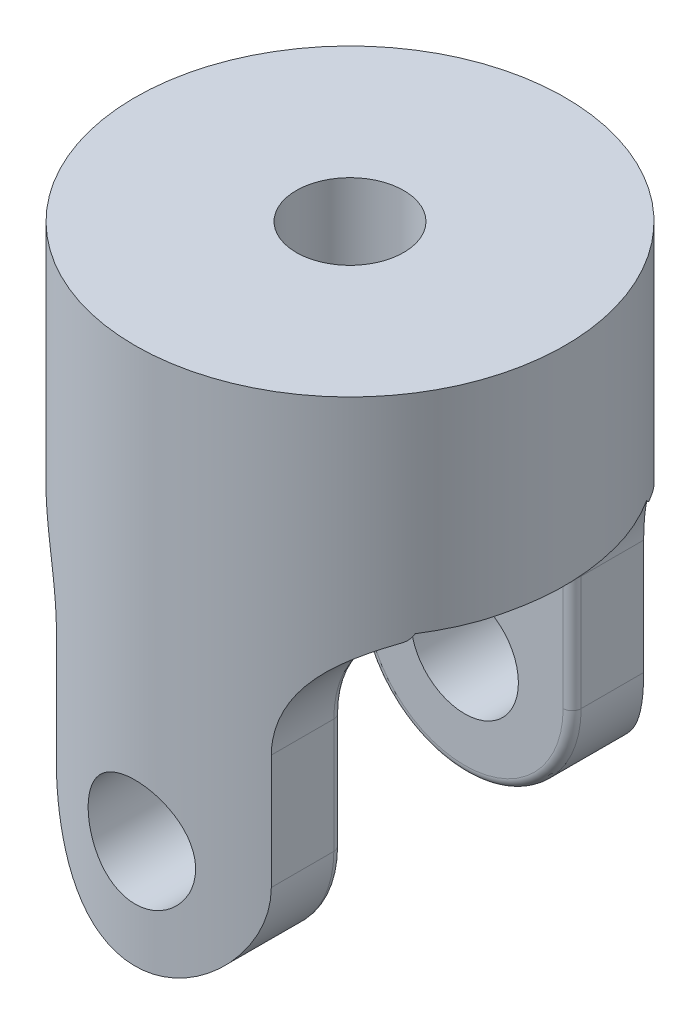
ISO-10303-21;
HEADER;
FILE_DESCRIPTION(('STEP AP214'),'2;1');
FILE_NAME('part.step','',(''),(''),'','','');
FILE_SCHEMA(('AUTOMOTIVE_DESIGN { 1 0 10303 214 1 1 1 1 }'));
ENDSEC;
DATA;
#1=APPLICATION_CONTEXT('core data for automotive mechanical design processes');
#2=APPLICATION_PROTOCOL_DEFINITION('international standard','automotive_design',2000,#1);
#3=PRODUCT_CONTEXT('',#1,'mechanical');
#4=PRODUCT('Part','Part','',(#3));
#5=PRODUCT_RELATED_PRODUCT_CATEGORY('part','',(#4));
#6=PRODUCT_DEFINITION_FORMATION('','',#4);
#7=PRODUCT_DEFINITION_CONTEXT('part definition',#1,'design');
#8=PRODUCT_DEFINITION('design','',#6,#7);
#9=PRODUCT_DEFINITION_SHAPE('','',#8);
#10=(LENGTH_UNIT() NAMED_UNIT(*) SI_UNIT(.MILLI.,.METRE.));
#11=(NAMED_UNIT(*) PLANE_ANGLE_UNIT() SI_UNIT($,.RADIAN.));
#12=(NAMED_UNIT(*) SI_UNIT($,.STERADIAN.) SOLID_ANGLE_UNIT());
#13=UNCERTAINTY_MEASURE_WITH_UNIT(LENGTH_MEASURE(1.E-05),#10,'distance_accuracy_value','');
#14=(GEOMETRIC_REPRESENTATION_CONTEXT(3) GLOBAL_UNCERTAINTY_ASSIGNED_CONTEXT((#13)) GLOBAL_UNIT_ASSIGNED_CONTEXT((#10,
#11,#12)) REPRESENTATION_CONTEXT('',''));
#15=CARTESIAN_POINT('',(0.,0.,0.));
#16=DIRECTION('',(0.,0.,1.));
#17=DIRECTION('',(1.,0.,0.));
#18=AXIS2_PLACEMENT_3D('',#15,#16,#17);
#19=CARTESIAN_POINT('',(0.,47.6250000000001,0.));
#20=DIRECTION('',(0.,-1.,0.));
#21=DIRECTION('',(0.,0.,-1.));
#22=AXIS2_PLACEMENT_3D('',#19,#20,#21);
#23=CYLINDRICAL_SURFACE('',#22,19.05);
#24=CARTESIAN_POINT('',(0.,14.2875,-19.05));
#25=CARTESIAN_POINT('',(-0.263131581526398,14.2874926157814,-19.0499955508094));
#26=CARTESIAN_POINT('',(-0.526345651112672,14.2656193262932,-19.0444938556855));
#27=CARTESIAN_POINT('',(-1.04523007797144,14.1788351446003,-19.0230796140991));
#28=CARTESIAN_POINT('',(-1.3008960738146,14.1138998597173,-19.0071611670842));
#29=CARTESIAN_POINT('',(-1.79711626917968,13.9432053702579,-18.966676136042));
#30=CARTESIAN_POINT('',(-2.03768821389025,13.837495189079,-18.9421199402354));
#31=CARTESIAN_POINT('',(-2.49768401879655,13.5884240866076,-18.886974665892));
#32=CARTESIAN_POINT('',(-2.71710716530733,13.4450618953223,-18.8563853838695));
#33=CARTESIAN_POINT('',(-3.13309611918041,13.121637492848,-18.7917903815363));
#34=CARTESIAN_POINT('',(-3.32916431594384,12.940945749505,-18.757731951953));
#35=CARTESIAN_POINT('',(-3.68855284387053,12.5493392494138,-18.6903874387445));
#36=CARTESIAN_POINT('',(-3.85186947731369,12.3384210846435,-18.6571014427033));
#37=CARTESIAN_POINT('',(-4.14345927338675,11.8884851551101,-18.5945391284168));
#38=CARTESIAN_POINT('',(-4.27117578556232,11.6490964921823,-18.5653297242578));
#39=CARTESIAN_POINT('',(-4.48436018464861,11.1513987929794,-18.514996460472));
#40=CARTESIAN_POINT('',(-4.56983482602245,10.8930927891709,-18.4938713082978));
#41=CARTESIAN_POINT('',(-4.69441160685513,10.3703643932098,-18.4626401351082));
#42=CARTESIAN_POINT('',(-4.73440845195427,10.1061682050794,-18.4523218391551));
#43=CARTESIAN_POINT('',(-4.76968113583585,9.57462979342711,-18.443237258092));
#44=CARTESIAN_POINT('',(-4.76496425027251,9.3072880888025,-18.4444690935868));
#45=CARTESIAN_POINT('',(-4.71165721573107,8.78390481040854,-18.458154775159));
#46=CARTESIAN_POINT('',(-4.66413323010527,8.5277464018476,-18.4703359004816));
#47=CARTESIAN_POINT('',(-4.52826179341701,8.02715866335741,-18.5041130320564));
#48=CARTESIAN_POINT('',(-4.43991143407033,7.7827301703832,-18.5257097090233));
#49=CARTESIAN_POINT('',(-4.22398659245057,7.30968179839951,-18.5761348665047));
#50=CARTESIAN_POINT('',(-4.09602516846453,7.08124640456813,-18.6050341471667));
#51=CARTESIAN_POINT('',(-3.80478117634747,6.64870809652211,-18.6667683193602));
#52=CARTESIAN_POINT('',(-3.64149242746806,6.44460944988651,-18.6996038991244));
#53=CARTESIAN_POINT('',(-3.27870637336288,6.06042852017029,-18.7666592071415));
#54=CARTESIAN_POINT('',(-3.07830936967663,5.88119699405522,-18.8008917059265));
#55=CARTESIAN_POINT('',(-2.64989283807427,5.55872255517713,-18.8660394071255));
#56=CARTESIAN_POINT('',(-2.42187246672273,5.41548074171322,-18.8969545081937));
#57=CARTESIAN_POINT('',(-1.94346794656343,5.16873938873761,-18.9521379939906));
#58=CARTESIAN_POINT('',(-1.69300967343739,5.0653780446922,-18.9763831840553));
#59=CARTESIAN_POINT('',(-1.17753132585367,4.9024625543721,-19.0153263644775));
#60=CARTESIAN_POINT('',(-0.9125140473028,4.84290002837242,-19.0300261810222));
#61=CARTESIAN_POINT('',(-0.382714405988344,4.7705722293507,-19.0479521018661));
#62=CARTESIAN_POINT('',(-0.118099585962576,4.75664839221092,-19.0514621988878));
#63=CARTESIAN_POINT('',(0.409679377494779,4.77281558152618,-19.0474220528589));
#64=CARTESIAN_POINT('',(0.672843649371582,4.80290264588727,-19.0398728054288));
#65=CARTESIAN_POINT('',(1.18622530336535,4.90528263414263,-19.0147442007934));
#66=CARTESIAN_POINT('',(1.43657675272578,4.97694351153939,-18.9973151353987));
#67=CARTESIAN_POINT('',(1.92169190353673,5.15971499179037,-18.9543914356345));
#68=CARTESIAN_POINT('',(2.15645402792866,5.2708295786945,-18.928895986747));
#69=CARTESIAN_POINT('',(2.6083359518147,5.53159970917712,-18.8719875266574));
#70=CARTESIAN_POINT('',(2.82506877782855,5.68190415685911,-18.8404775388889));
#71=CARTESIAN_POINT('',(3.23064699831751,6.015957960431,-18.7751881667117));
#72=CARTESIAN_POINT('',(3.41948756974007,6.199713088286,-18.7414083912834));
#73=CARTESIAN_POINT('',(3.76869505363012,6.60083122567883,-18.6743643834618));
#74=CARTESIAN_POINT('',(3.92824927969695,6.81890845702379,-18.6411331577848));
#75=CARTESIAN_POINT('',(4.20849665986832,7.27942611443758,-18.5798738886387));
#76=CARTESIAN_POINT('',(4.32919153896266,7.52186545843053,-18.5518456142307));
#77=CARTESIAN_POINT('',(4.52739576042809,8.02292566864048,-18.5044745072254));
#78=CARTESIAN_POINT('',(4.60516095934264,8.28144021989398,-18.4850803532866));
#79=CARTESIAN_POINT('',(4.71597247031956,8.80843310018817,-18.457124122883));
#80=CARTESIAN_POINT('',(4.74902856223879,9.07690923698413,-18.4485596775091));
#81=CARTESIAN_POINT('',(4.7689725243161,9.60793425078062,-18.4434131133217));
#82=CARTESIAN_POINT('',(4.75715932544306,9.87043185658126,-18.4464938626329));
#83=CARTESIAN_POINT('',(4.69067285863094,10.3895648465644,-18.4635111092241));
#84=CARTESIAN_POINT('',(4.63600045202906,10.6462003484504,-18.4774473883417));
#85=CARTESIAN_POINT('',(4.48605693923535,11.1449118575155,-18.5144175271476));
#86=CARTESIAN_POINT('',(4.39102945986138,11.3870654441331,-18.5373967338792));
#87=CARTESIAN_POINT('',(4.16326610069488,11.8521650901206,-18.5898712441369));
#88=CARTESIAN_POINT('',(4.03052499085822,12.0751084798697,-18.6193674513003));
#89=CARTESIAN_POINT('',(3.72703010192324,12.5017359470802,-18.6825138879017));
#90=CARTESIAN_POINT('',(3.55537504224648,12.7047659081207,-18.7162524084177));
#91=CARTESIAN_POINT('',(3.1806812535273,13.0795618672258,-18.7835548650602));
#92=CARTESIAN_POINT('',(2.97763508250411,13.2513204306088,-18.8171187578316));
#93=CARTESIAN_POINT('',(2.54148458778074,13.5617309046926,-18.8810155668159));
#94=CARTESIAN_POINT('',(2.30790249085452,13.6997268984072,-18.911278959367));
#95=CARTESIAN_POINT('',(1.82011973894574,13.9342731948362,-18.9644313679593));
#96=CARTESIAN_POINT('',(1.56593401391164,14.0308531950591,-18.9873256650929));
#97=CARTESIAN_POINT('',(1.09350255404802,14.1654905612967,-19.0197758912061));
#98=CARTESIAN_POINT('',(0.877507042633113,14.2111451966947,-19.031032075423));
#99=CARTESIAN_POINT('',(0.441026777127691,14.2721518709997,-19.0461457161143));
#100=CARTESIAN_POINT('',(0.2205423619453,14.2875061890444,-19.0500037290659));
#101=CARTESIAN_POINT('',(0.,14.2875,-19.05));
#102=B_SPLINE_CURVE_WITH_KNOTS('',3,(#24,#25,#26,#27,#28,#29,#30,#31,#32,#33,#34,#35,#36,#37,
#38,#39,#40,#41,#42,#43,#44,#45,#46,#47,#48,#49,#50,#51,#52,#53,#54,#55,#56,#57,#58,#59,#60,#61,
#62,#63,#64,#65,#66,#67,#68,#69,#70,#71,#72,#73,#74,#75,#76,#77,#78,#79,#80,#81,#82,#83,#84,#85,
#86,#87,#88,#89,#90,#91,#92,#93,#94,#95,#96,#97,#98,#99,#100,#101),.UNSPECIFIED.,.T.,.F.,(4,2,2,
2,2,2,2,2,2,2,2,2,2,2,2,2,2,2,2,2,2,2,2,2,2,2,2,2,2,2,2,2,2,2,2,2,2,2,4),(0.,0.788586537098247,
1.57762015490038,2.36570806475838,3.1538225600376,3.95650832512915,4.75928466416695,
5.57398705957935,6.38855914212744,7.18681236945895,7.98493571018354,8.76371428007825,
9.54254833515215,10.3292442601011,11.1160779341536,11.9253476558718,12.7346420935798,
13.5467162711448,14.3586350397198,15.149776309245,15.940846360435,16.7201937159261,
17.4996197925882,18.2928764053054,19.08627002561,19.8991381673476,20.7119702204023,
21.51990408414,22.3276611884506,23.1122150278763,23.8967531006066,24.6766207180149,
25.4565965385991,26.2569190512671,27.0574315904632,27.8724418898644,28.6868668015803,
29.3478662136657,30.008815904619),.UNSPECIFIED.);
#103=CARTESIAN_POINT('',(0.,14.2875,-19.05));
#104=VERTEX_POINT('',#103);
#105=EDGE_CURVE('E283',#104,#104,#102,.T.);
#106=ORIENTED_EDGE('',*,*,#105,.T.);
#107=EDGE_LOOP('',(#106));
#108=FACE_BOUND('',#107,.T.);
#109=CARTESIAN_POINT('',(4.76250000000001,9.525,18.4450831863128));
#110=CARTESIAN_POINT('',(4.76249252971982,9.26201331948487,18.4450882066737));
#111=CARTESIAN_POINT('',(4.74064249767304,8.99894396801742,18.4507690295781));
#112=CARTESIAN_POINT('',(4.65395905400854,8.48035976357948,18.4728204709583));
#113=CARTESIAN_POINT('',(4.58910062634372,8.22484939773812,18.4891973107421));
#114=CARTESIAN_POINT('',(4.41863073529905,7.72895925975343,18.5306727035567));
#115=CARTESIAN_POINT('',(4.31307188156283,7.48856041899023,18.5557599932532));
#116=CARTESIAN_POINT('',(4.06435777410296,7.02885782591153,18.6118155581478));
#117=CARTESIAN_POINT('',(3.92120092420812,6.8095549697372,18.6427840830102));
#118=CARTESIAN_POINT('',(3.59798955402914,6.39344356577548,18.7078756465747));
#119=CARTESIAN_POINT('',(3.41725927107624,6.19716769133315,18.7420490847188));
#120=CARTESIAN_POINT('',(3.02548683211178,5.83737454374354,18.8092627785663));
#121=CARTESIAN_POINT('',(2.8144418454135,5.67386033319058,18.8423029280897));
#122=CARTESIAN_POINT('',(2.36438160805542,5.38205273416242,18.9040849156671));
#123=CARTESIAN_POINT('',(2.12501716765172,5.25428263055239,18.9327603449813));
#124=CARTESIAN_POINT('',(1.62737136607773,5.04099262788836,18.98200696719));
#125=CARTESIAN_POINT('',(1.36909280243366,4.95546649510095,19.0025793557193));
#126=CARTESIAN_POINT('',(0.846503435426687,4.8307983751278,19.0329456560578));
#127=CARTESIAN_POINT('',(0.58242083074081,4.79075182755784,19.0429494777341));
#128=CARTESIAN_POINT('',(0.0511089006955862,4.75534028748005,19.0517829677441));
#129=CARTESIAN_POINT('',(-0.216119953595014,4.75996868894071,19.0506142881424));
#130=CARTESIAN_POINT('',(-0.73986507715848,4.8131250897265,19.0373907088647));
#131=CARTESIAN_POINT('',(-0.996487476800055,4.86067669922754,19.0255779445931));
#132=CARTESIAN_POINT('',(-1.49798840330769,4.99676026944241,18.992675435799));
#133=CARTESIAN_POINT('',(-1.74286630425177,5.08529441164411,18.9715851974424));
#134=CARTESIAN_POINT('',(-2.21649942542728,5.30161989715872,18.9221270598));
#135=CARTESIAN_POINT('',(-2.44508897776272,5.42975872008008,18.8936951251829));
#136=CARTESIAN_POINT('',(-2.87786265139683,5.72139256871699,18.8326376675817));
#137=CARTESIAN_POINT('',(-3.08204251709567,5.88489374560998,18.8000114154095));
#138=CARTESIAN_POINT('',(-3.46602384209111,6.24784515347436,18.733078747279));
#139=CARTESIAN_POINT('',(-3.6450159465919,6.44814856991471,18.6987507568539));
#140=CARTESIAN_POINT('',(-3.9670499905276,6.87628794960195,18.633091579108));
#141=CARTESIAN_POINT('',(-4.11009024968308,7.10412519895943,18.6017605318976));
#142=CARTESIAN_POINT('',(-4.35667846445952,7.58245251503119,18.5455654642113));
#143=CARTESIAN_POINT('',(-4.46003156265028,7.83304706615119,18.5207335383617));
#144=CARTESIAN_POINT('',(-4.62289026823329,8.34882531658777,18.4807600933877));
#145=CARTESIAN_POINT('',(-4.68240525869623,8.61400588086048,18.4656165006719));
#146=CARTESIAN_POINT('',(-4.75455546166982,9.14392285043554,18.4471695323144));
#147=CARTESIAN_POINT('',(-4.76838735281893,9.40848599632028,18.4435639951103));
#148=CARTESIAN_POINT('',(-4.75205486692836,9.93614078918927,18.4477788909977));
#149=CARTESIAN_POINT('',(-4.72189453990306,10.1992325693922,18.4555982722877));
#150=CARTESIAN_POINT('',(-4.61948300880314,10.7120326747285,18.48149241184));
#151=CARTESIAN_POINT('',(-4.54792855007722,10.9618895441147,18.4993972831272));
#152=CARTESIAN_POINT('',(-4.365532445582,11.4460619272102,18.5432836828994));
#153=CARTESIAN_POINT('',(-4.25468614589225,11.6803755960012,18.5692661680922));
#154=CARTESIAN_POINT('',(-3.99434812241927,12.1318806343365,18.6270164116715));
#155=CARTESIAN_POINT('',(-3.84414094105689,12.3486459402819,18.6588876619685));
#156=CARTESIAN_POINT('',(-3.51024964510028,12.7543338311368,18.7245704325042));
#157=CARTESIAN_POINT('',(-3.32656002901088,12.9432518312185,18.7583822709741));
#158=CARTESIAN_POINT('',(-2.92542620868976,13.2927300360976,18.8251605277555));
#159=CARTESIAN_POINT('',(-2.70725242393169,13.4524624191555,18.8580846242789));
#160=CARTESIAN_POINT('',(-2.24648402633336,13.7330228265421,18.9185019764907));
#161=CARTESIAN_POINT('',(-2.00389068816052,13.8538528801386,18.9459955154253));
#162=CARTESIAN_POINT('',(-1.50284593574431,14.0521296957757,18.9922807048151));
#163=CARTESIAN_POINT('',(-1.24452402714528,14.1298884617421,19.0111347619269));
#164=CARTESIAN_POINT('',(-0.717945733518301,14.240751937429,19.0382898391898));
#165=CARTESIAN_POINT('',(-0.449691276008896,14.2738652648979,19.0465928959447));
#166=CARTESIAN_POINT('',(0.0813602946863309,14.2940131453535,19.0516273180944));
#167=CARTESIAN_POINT('',(0.34410885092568,14.2822693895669,19.0486654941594));
#168=CARTESIAN_POINT('',(0.863762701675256,14.2158347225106,19.0321833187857));
#169=CARTESIAN_POINT('',(1.12066816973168,14.1611450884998,19.0186632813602));
#170=CARTESIAN_POINT('',(1.62006455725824,14.0110263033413,18.9826312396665));
#171=CARTESIAN_POINT('',(1.86262563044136,13.9158180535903,18.9601680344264));
#172=CARTESIAN_POINT('',(2.32846746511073,13.6875651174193,18.908615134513));
#173=CARTESIAN_POINT('',(2.55174579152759,13.5545156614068,18.8795246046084));
#174=CARTESIAN_POINT('',(2.97847668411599,13.2506311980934,18.8169827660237));
#175=CARTESIAN_POINT('',(3.18132613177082,13.0789673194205,18.7834436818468));
#176=CARTESIAN_POINT('',(3.55575403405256,12.7043361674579,18.7161796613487));
#177=CARTESIAN_POINT('',(3.72732454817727,12.5013609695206,18.6824546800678));
#178=CARTESIAN_POINT('',(4.03746665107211,12.0653107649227,18.6179210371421));
#179=CARTESIAN_POINT('',(4.1753628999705,11.831744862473,18.5871785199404));
#180=CARTESIAN_POINT('',(4.4097268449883,11.3440107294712,18.5329808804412));
#181=CARTESIAN_POINT('',(4.50622468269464,11.0898576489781,18.5095204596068));
#182=CARTESIAN_POINT('',(4.64068729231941,10.6176269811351,18.4762096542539));
#183=CARTESIAN_POINT('',(4.68626747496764,10.401808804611,18.4646250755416));
#184=CARTESIAN_POINT('',(4.74717566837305,9.96567951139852,18.4490600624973));
#185=CARTESIAN_POINT('',(4.76250625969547,9.74536877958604,18.4450789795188));
#186=CARTESIAN_POINT('',(4.76250000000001,9.525,18.4450831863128));
#187=B_SPLINE_CURVE_WITH_KNOTS('',3,(#109,#110,#111,#112,#113,#114,#115,#116,#117,#118,#119,
#120,#121,#122,#123,#124,#125,#126,#127,#128,#129,#130,#131,#132,#133,#134,#135,#136,#137,#138,
#139,#140,#141,#142,#143,#144,#145,#146,#147,#148,#149,#150,#151,#152,#153,#154,#155,#156,#157,
#158,#159,#160,#161,#162,#163,#164,#165,#166,#167,#168,#169,#170,#171,#172,#173,#174,#175,#176,
#177,#178,#179,#180,#181,#182,#183,#184,#185,#186),.UNSPECIFIED.,.T.,.F.,(4,2,2,2,2,2,2,2,2,2,2,
2,2,2,2,2,2,2,2,2,2,2,2,2,2,2,2,2,2,2,2,2,2,2,2,2,2,2,4),(0.,0.788150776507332,1.5767603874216,
2.36435403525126,3.15198112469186,3.95523632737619,4.75856658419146,5.57310600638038,
6.38752519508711,7.18544570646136,7.9832482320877,8.76334790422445,9.54348910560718,
10.3306792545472,11.1180064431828,11.9266423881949,12.7353161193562,13.5479110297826,
14.3603319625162,15.1512950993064,15.942185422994,16.7201355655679,17.4981778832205,
18.2914832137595,19.0849190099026,19.8982075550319,20.7114536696,21.5187289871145,
22.3258484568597,23.1111446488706,23.896417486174,24.677462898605,25.4586067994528,
26.258464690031,27.0585253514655,27.8735118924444,28.6879040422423,29.3483886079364,
30.0088168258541),.UNSPECIFIED.);
#188=CARTESIAN_POINT('',(4.76250000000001,9.525,18.4450831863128));
#189=VERTEX_POINT('',#188);
#190=EDGE_CURVE('E291',#189,#189,#187,.T.);
#191=ORIENTED_EDGE('',*,*,#190,.T.);
#192=EDGE_LOOP('',(#191));
#193=FACE_BOUND('',#192,.T.);
#194=CARTESIAN_POINT('',(0.,47.6250000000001,0.));
#195=DIRECTION('',(0.,1.,0.));
#196=DIRECTION('',(0.,0.,1.));
#197=AXIS2_PLACEMENT_3D('',#194,#195,#196);
#198=CIRCLE('',#197,19.05);
#199=CARTESIAN_POINT('',(0.,47.625,19.05));
#200=VERTEX_POINT('',#199);
#201=EDGE_CURVE('E209',#200,#200,#198,.T.);
#202=ORIENTED_EDGE('',*,*,#201,.F.);
#203=EDGE_LOOP('',(#202));
#204=FACE_BOUND('',#203,.T.);
#205=CARTESIAN_POINT('',(0.,29.1452388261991,0.));
#206=DIRECTION('',(0.,1.,0.));
#207=DIRECTION('',(0.,0.,1.));
#208=AXIS2_PLACEMENT_3D('',#205,#206,#207);
#209=CIRCLE('',#208,19.05);
#210=CARTESIAN_POINT('',(-17.9411689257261,29.1452388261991,6.40444826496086));
#211=VERTEX_POINT('',#210);
#212=CARTESIAN_POINT('',(-16.0465941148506,29.1452388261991,10.2669039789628));
#213=VERTEX_POINT('',#212);
#214=EDGE_CURVE('E194',#211,#213,#209,.T.);
#215=ORIENTED_EDGE('',*,*,#214,.T.);
#216=CARTESIAN_POINT('',(-16.0465941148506,29.1452388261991,10.2669039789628));
#217=CARTESIAN_POINT('',(-16.0372768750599,29.1157831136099,10.2814663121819));
#218=CARTESIAN_POINT('',(-16.0271745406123,29.0872011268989,10.2972119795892));
#219=CARTESIAN_POINT('',(-16.0055557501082,29.0318945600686,10.3307833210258));
#220=CARTESIAN_POINT('',(-15.9940408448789,29.0051679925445,10.3486067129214));
#221=CARTESIAN_POINT('',(-15.9576708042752,28.9280401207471,10.4046726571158));
#222=CARTESIAN_POINT('',(-15.9309167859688,28.8804640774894,10.4456265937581));
#223=CARTESIAN_POINT('',(-15.8742304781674,28.7948098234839,10.5315660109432));
#224=CARTESIAN_POINT('',(-15.8444182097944,28.7564886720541,10.5763928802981));
#225=CARTESIAN_POINT('',(-15.7816164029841,28.6878878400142,10.6698758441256));
#226=CARTESIAN_POINT('',(-15.7486256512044,28.6576112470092,10.7185333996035));
#227=CARTESIAN_POINT('',(-15.6930675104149,28.6155571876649,10.7996090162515));
#228=CARTESIAN_POINT('',(-15.6712796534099,28.6011148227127,10.8312051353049));
#229=CARTESIAN_POINT('',(-15.6268999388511,28.575819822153,10.8951372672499));
#230=CARTESIAN_POINT('',(-15.6043100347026,28.564959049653,10.9274714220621));
#231=CARTESIAN_POINT('',(-15.5813577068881,28.5559720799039,10.9601));
#232=B_SPLINE_CURVE_WITH_KNOTS('',3,(#216,#217,#218,#219,#220,#221,#222,#223,#224,#225,#226,
#227,#228,#229,#230,#231),.UNSPECIFIED.,.F.,.F.,(4,2,2,2,2,2,2,4),(0.,0.10236379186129,
0.204616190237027,0.408337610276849,0.605922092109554,0.803582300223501,0.926449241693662,
1.04903509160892),.UNSPECIFIED.);
#233=CARTESIAN_POINT('',(-15.5813577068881,28.5559720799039,10.9601));
#234=VERTEX_POINT('',#233);
#235=EDGE_CURVE('E374',#213,#234,#232,.T.);
#236=ORIENTED_EDGE('',*,*,#235,.T.);
#237=CARTESIAN_POINT('',(-9.525,19.685,-16.4977839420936));
#238=CARTESIAN_POINT('',(-9.52496088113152,19.9183502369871,-16.4977688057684));
#239=CARTESIAN_POINT('',(-9.53357353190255,20.1516967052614,-16.4928328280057));
#240=CARTESIAN_POINT('',(-9.5678214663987,20.6166980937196,-16.4730087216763));
#241=CARTESIAN_POINT('',(-9.59345572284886,20.8483531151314,-16.4581211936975));
#242=CARTESIAN_POINT('',(-9.66141942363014,21.3080009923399,-16.4183108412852));
#243=CARTESIAN_POINT('',(-9.70372594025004,21.5359984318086,-16.3934017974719));
#244=CARTESIAN_POINT('',(-9.80447669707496,21.9870210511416,-16.3333461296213));
#245=CARTESIAN_POINT('',(-9.8629206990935,22.210046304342,-16.2981996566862));
#246=CARTESIAN_POINT('',(-9.99521577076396,22.6496636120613,-16.217402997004));
#247=CARTESIAN_POINT('',(-10.0690752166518,22.8662520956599,-16.1717470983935));
#248=CARTESIAN_POINT('',(-10.2311827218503,23.2913603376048,-16.0696785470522));
#249=CARTESIAN_POINT('',(-10.3194309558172,23.4998799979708,-16.0132657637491));
#250=CARTESIAN_POINT('',(-10.5090589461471,23.9073731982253,-15.8894615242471));
#251=CARTESIAN_POINT('',(-10.6104339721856,24.1063501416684,-15.8220740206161));
#252=CARTESIAN_POINT('',(-10.8249101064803,24.4935871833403,-15.676116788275));
#253=CARTESIAN_POINT('',(-10.9380111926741,24.6818473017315,-15.597547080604));
#254=CARTESIAN_POINT('',(-11.1750060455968,25.0476354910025,-15.4286429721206));
#255=CARTESIAN_POINT('',(-11.2989577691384,25.2250961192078,-15.3382439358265));
#256=CARTESIAN_POINT('',(-11.5553164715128,25.5672655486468,-15.1460495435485));
#257=CARTESIAN_POINT('',(-11.6877234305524,25.7319743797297,-15.0442542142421));
#258=CARTESIAN_POINT('',(-11.9591574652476,26.0480960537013,-14.8293967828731));
#259=CARTESIAN_POINT('',(-12.0981857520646,26.1995064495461,-14.7163326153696));
#260=CARTESIAN_POINT('',(-12.3809708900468,26.4887188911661,-14.4792302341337));
#261=CARTESIAN_POINT('',(-12.5247282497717,26.6265194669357,-14.3551908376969));
#262=CARTESIAN_POINT('',(-12.8240785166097,26.8965620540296,-14.0885806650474));
#263=CARTESIAN_POINT('',(-12.9798547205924,27.0279377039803,-13.9453388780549));
#264=CARTESIAN_POINT('',(-13.292575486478,27.2756182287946,-13.6475843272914));
#265=CARTESIAN_POINT('',(-13.44952006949,27.3919228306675,-13.4930713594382));
#266=CARTESIAN_POINT('',(-13.7627279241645,27.6100750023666,-13.1734537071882));
#267=CARTESIAN_POINT('',(-13.91899104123,27.7119194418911,-13.0083467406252));
#268=CARTESIAN_POINT('',(-14.2291584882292,27.9019462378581,-12.6683290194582));
#269=CARTESIAN_POINT('',(-14.3830623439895,27.9901258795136,-12.4934163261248));
#270=CARTESIAN_POINT('',(-14.7634251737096,28.1948863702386,-12.0444336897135));
#271=CARTESIAN_POINT('',(-14.9875078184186,28.3034922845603,-11.7646791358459));
#272=CARTESIAN_POINT('',(-15.4232003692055,28.4957157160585,-11.1874194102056));
#273=CARTESIAN_POINT('',(-15.6348051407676,28.5793230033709,-10.8899070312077));
#274=CARTESIAN_POINT('',(-16.0431146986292,28.7255421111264,-10.2789237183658));
#275=CARTESIAN_POINT('',(-16.2397846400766,28.7881059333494,-9.96541815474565));
#276=CARTESIAN_POINT('',(-16.615638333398,28.8957388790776,-9.32528378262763));
#277=CARTESIAN_POINT('',(-16.7948218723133,28.9408077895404,-8.99865481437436));
#278=CARTESIAN_POINT('',(-17.1918461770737,29.029905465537,-8.22145899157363));
#279=CARTESIAN_POINT('',(-17.4021973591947,29.0684013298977,-7.76641658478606));
#280=CARTESIAN_POINT('',(-17.786699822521,29.1278564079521,-6.84014068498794));
#281=CARTESIAN_POINT('',(-17.9608394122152,29.1488099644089,-6.36890201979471));
#282=CARTESIAN_POINT('',(-18.2714417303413,29.1794105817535,-5.4137888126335));
#283=CARTESIAN_POINT('',(-18.4079009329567,29.1890565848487,-4.92991309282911));
#284=CARTESIAN_POINT('',(-18.6421466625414,29.2019870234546,-3.95287775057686));
#285=CARTESIAN_POINT('',(-18.7399368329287,29.205272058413,-3.45971900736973));
#286=CARTESIAN_POINT('',(-18.897358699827,29.2091078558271,-2.46008138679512));
#287=CARTESIAN_POINT('',(-18.9564226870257,29.2096187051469,-1.95351291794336));
#288=CARTESIAN_POINT('',(-19.033752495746,29.2100647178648,-0.937263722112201));
#289=CARTESIAN_POINT('',(-19.0520174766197,29.209999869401,-0.427582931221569));
#290=CARTESIAN_POINT('',(-19.0476285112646,29.2100001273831,0.591825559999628));
#291=CARTESIAN_POINT('',(-19.0249568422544,29.2100652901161,1.10155318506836));
#292=CARTESIAN_POINT('',(-18.9388075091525,29.2094475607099,2.11754548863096));
#293=CARTESIAN_POINT('',(-18.8753295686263,29.2087646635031,2.6238101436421));
#294=CARTESIAN_POINT('',(-18.7036160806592,29.2041086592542,3.65580332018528));
#295=CARTESIAN_POINT('',(-18.5932233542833,29.1999661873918,4.18117378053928));
#296=CARTESIAN_POINT('',(-18.3285057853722,29.1835599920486,5.2207365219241));
#297=CARTESIAN_POINT('',(-18.1741722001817,29.1712946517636,5.73492655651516));
#298=CARTESIAN_POINT('',(-17.8230306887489,29.1322930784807,6.7475164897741));
#299=CARTESIAN_POINT('',(-17.6262637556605,29.1055707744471,7.24593109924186));
#300=CARTESIAN_POINT('',(-17.1921907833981,29.0296619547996,8.22291578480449));
#301=CARTESIAN_POINT('',(-16.9549063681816,28.9804873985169,8.7014962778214));
#302=CARTESIAN_POINT('',(-16.531748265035,28.8726944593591,9.47232063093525));
#303=CARTESIAN_POINT('',(-16.356505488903,28.8232353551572,9.77172744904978));
#304=CARTESIAN_POINT('',(-15.9915321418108,28.7076409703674,10.3582119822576));
#305=CARTESIAN_POINT('',(-15.8018055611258,28.6415102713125,10.6452930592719));
#306=CARTESIAN_POINT('',(-15.4100602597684,28.4895738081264,11.2048655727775));
#307=CARTESIAN_POINT('',(-15.2080616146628,28.4037995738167,11.4773795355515));
#308=CARTESIAN_POINT('',(-14.794100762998,28.2093882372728,12.0062371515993));
#309=CARTESIAN_POINT('',(-14.5821407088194,28.1007560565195,12.2625842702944));
#310=CARTESIAN_POINT('',(-14.1961331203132,27.8828084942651,12.7059055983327));
#311=CARTESIAN_POINT('',(-14.0232896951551,27.7782615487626,12.8962780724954));
#312=CARTESIAN_POINT('',(-13.6756323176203,27.5516907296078,13.2643740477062));
#313=CARTESIAN_POINT('',(-13.5008188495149,27.4296710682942,13.4421005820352));
#314=CARTESIAN_POINT('',(-13.1516762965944,27.1671845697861,13.7838888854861));
#315=CARTESIAN_POINT('',(-12.9773471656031,27.0267195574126,13.947952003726));
#316=CARTESIAN_POINT('',(-12.6319391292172,26.7267630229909,14.2615225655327));
#317=CARTESIAN_POINT('',(-12.4608602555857,26.5672713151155,14.4110298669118));
#318=CARTESIAN_POINT('',(-12.1237135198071,26.2279198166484,14.6958204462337));
#319=CARTESIAN_POINT('',(-11.957692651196,26.0479167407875,14.8309890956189));
#320=CARTESIAN_POINT('',(-11.6351953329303,25.6689938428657,15.0853214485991));
#321=CARTESIAN_POINT('',(-11.4787191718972,25.4700734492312,15.2044846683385));
#322=CARTESIAN_POINT('',(-11.1784747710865,25.0543983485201,15.4265708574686));
#323=CARTESIAN_POINT('',(-11.0347050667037,24.8376457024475,15.5294956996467));
#324=CARTESIAN_POINT('',(-10.7628059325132,24.3878782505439,15.7191604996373));
#325=CARTESIAN_POINT('',(-10.6346741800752,24.154865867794,15.8059028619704));
#326=CARTESIAN_POINT('',(-10.4115375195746,23.7046522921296,15.9536199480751));
#327=CARTESIAN_POINT('',(-10.3143937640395,23.4891174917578,16.0164604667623));
#328=CARTESIAN_POINT('',(-10.1355425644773,23.04871010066,16.1302361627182));
#329=CARTESIAN_POINT('',(-10.0538339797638,22.8238382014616,16.1811722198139));
#330=CARTESIAN_POINT('',(-9.90713729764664,22.3666546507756,16.2714028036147));
#331=CARTESIAN_POINT('',(-9.84213485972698,22.1343495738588,16.3107073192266));
#332=CARTESIAN_POINT('',(-9.72972257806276,21.6640173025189,16.3780123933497));
#333=CARTESIAN_POINT('',(-9.6823065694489,21.4259921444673,16.4060169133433));
#334=CARTESIAN_POINT('',(-9.60449707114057,20.9383691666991,16.4516946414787));
#335=CARTESIAN_POINT('',(-9.57468865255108,20.6886433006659,16.4690135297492));
#336=CARTESIAN_POINT('',(-9.54488066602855,20.3127872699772,16.48629321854));
#337=CARTESIAN_POINT('',(-9.5374287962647,20.1873921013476,16.4906033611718));
#338=CARTESIAN_POINT('',(-9.52748802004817,19.9363374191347,16.4963477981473));
#339=CARTESIAN_POINT('',(-9.52499919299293,19.8106779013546,16.4977820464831));
#340=CARTESIAN_POINT('',(-9.525,19.685,16.4977839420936));
#341=B_SPLINE_CURVE_WITH_KNOTS('',3,(#237,#238,#239,#240,#241,#242,#243,#244,#245,#246,#247,
#248,#249,#250,#251,#252,#253,#254,#255,#256,#257,#258,#259,#260,#261,#262,#263,#264,#265,#266,
#267,#268,#269,#270,#271,#272,#273,#274,#275,#276,#277,#278,#279,#280,#281,#282,#283,#284,#285,
#286,#287,#288,#289,#290,#291,#292,#293,#294,#295,#296,#297,#298,#299,#300,#301,#302,#303,#304,
#305,#306,#307,#308,#309,#310,#311,#312,#313,#314,#315,#316,#317,#318,#319,#320,#321,#322,#323,
#324,#325,#326,#327,#328,#329,#330,#331,#332,#333,#334,#335,#336,#337,#338,#339,#340),
.UNSPECIFIED.,.F.,.F.,(4,2,2,2,2,2,2,2,2,2,2,2,2,2,2,2,2,2,2,2,2,2,2,2,2,2,2,2,2,2,2,2,2,2,2,2,
2,2,2,2,2,2,2,2,2,2,2,2,2,2,2,4),(0.,0.699834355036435,1.39962647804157,2.09845958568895,
2.79728237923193,3.49648588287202,4.19569787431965,4.89465859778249,5.59361800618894,
6.29656980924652,6.99951996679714,7.70259920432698,8.40575429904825,9.15225685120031,
9.89877292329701,10.6454503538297,11.3922759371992,12.514141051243,13.6364646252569,
14.761331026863,15.886211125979,17.3924586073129,18.8991916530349,20.40606563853,
21.9127976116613,23.4411511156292,24.9695361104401,26.4985829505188,28.0276401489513,
29.6362655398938,31.2452112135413,32.852609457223,34.4591525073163,35.50965675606,
36.5598726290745,37.6084144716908,38.6567307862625,39.4886840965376,40.3204371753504,
41.1521080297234,41.9837870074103,42.8216802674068,43.6595988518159,44.4974207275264,
45.3351180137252,46.0680642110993,46.8009562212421,47.5332170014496,48.2652208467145,
49.0203491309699,49.3973072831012,49.7742714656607),.UNSPECIFIED.);
#342=CARTESIAN_POINT('',(-9.52499999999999,19.685,16.4977839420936));
#343=VERTEX_POINT('',#342);
#344=EDGE_CURVE('E508',#234,#343,#341,.T.);
#345=ORIENTED_EDGE('',*,*,#344,.T.);
#346=DIRECTION('',(0.,-1.,0.));
#347=VECTOR('',#346,1.);
#348=CARTESIAN_POINT('',(-9.52499999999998,47.625,16.4977839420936));
#349=LINE('',#348,#347);
#350=CARTESIAN_POINT('',(-9.525,9.52500000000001,16.4977839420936));
#351=VERTEX_POINT('',#350);
#352=EDGE_CURVE('E509',#343,#351,#349,.T.);
#353=ORIENTED_EDGE('',*,*,#352,.T.);
#354=CARTESIAN_POINT('',(9.52500000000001,9.52500000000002,16.4977839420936));
#355=CARTESIAN_POINT('',(9.52500093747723,9.40027257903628,16.4977810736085));
#356=CARTESIAN_POINT('',(9.52254955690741,9.27556275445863,16.4991989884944));
#357=CARTESIAN_POINT('',(9.51275833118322,9.02640408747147,16.504847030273));
#358=CARTESIAN_POINT('',(9.50541869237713,8.901955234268,16.5090770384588));
#359=CARTESIAN_POINT('',(9.47610793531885,8.52953393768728,16.5259318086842));
#360=CARTESIAN_POINT('',(9.44684491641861,8.28227418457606,16.5427214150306));
#361=CARTESIAN_POINT('',(9.36949132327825,7.79316834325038,16.5866536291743));
#362=CARTESIAN_POINT('',(9.32150961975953,7.55129934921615,16.6137363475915));
#363=CARTESIAN_POINT('',(9.20730560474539,7.07314911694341,16.6772985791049));
#364=CARTESIAN_POINT('',(9.14108119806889,6.83686852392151,16.7137791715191));
#365=CARTESIAN_POINT('',(8.99129510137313,6.37194751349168,16.7948306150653));
#366=CARTESIAN_POINT('',(8.90777526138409,6.14329017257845,16.8393819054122));
#367=CARTESIAN_POINT('',(8.72407711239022,5.69420111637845,16.9352799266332));
#368=CARTESIAN_POINT('',(8.62389244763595,5.47377257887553,16.9866292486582));
#369=CARTESIAN_POINT('',(8.29930376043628,4.8260140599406,17.1488381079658));
#370=CARTESIAN_POINT('',(8.0509510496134,4.41247529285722,17.2678097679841));
#371=CARTESIAN_POINT('',(7.47383610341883,3.59736922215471,17.5257462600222));
#372=CARTESIAN_POINT('',(7.14015861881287,3.19954734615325,17.6655504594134));
#373=CARTESIAN_POINT('',(6.59457427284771,2.64718480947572,17.8732248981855));
#374=CARTESIAN_POINT('',(6.40509661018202,2.47038257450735,17.9421446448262));
#375=CARTESIAN_POINT('',(6.01181385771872,2.13237428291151,18.0777156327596));
#376=CARTESIAN_POINT('',(5.80800671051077,1.97117047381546,18.1443665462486));
#377=CARTESIAN_POINT('',(5.37278064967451,1.65505544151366,18.2781569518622));
#378=CARTESIAN_POINT('',(5.14042653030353,1.50131409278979,18.3450225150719));
#379=CARTESIAN_POINT('',(4.66194023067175,1.21417930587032,18.4724136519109));
#380=CARTESIAN_POINT('',(4.41581396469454,1.08077722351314,18.5329419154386));
#381=CARTESIAN_POINT('',(3.91130485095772,0.835583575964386,18.6459377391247));
#382=CARTESIAN_POINT('',(3.65292491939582,0.723786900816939,18.6984072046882));
#383=CARTESIAN_POINT('',(3.12571930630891,0.523053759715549,18.7937250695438));
#384=CARTESIAN_POINT('',(2.85689473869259,0.434114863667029,18.836574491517));
#385=CARTESIAN_POINT('',(2.33040396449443,0.285723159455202,18.9086545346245));
#386=CARTESIAN_POINT('',(2.07330466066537,0.22462268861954,18.9386372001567));
#387=CARTESIAN_POINT('',(1.55394863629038,0.123892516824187,18.9883061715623));
#388=CARTESIAN_POINT('',(1.29169214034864,0.0842618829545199,19.0079929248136));
#389=CARTESIAN_POINT('',(0.764329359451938,0.0270138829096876,19.0364912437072));
#390=CARTESIAN_POINT('',(0.499224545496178,0.00938565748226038,19.0453081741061));
#391=CARTESIAN_POINT('',(-0.0316607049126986,-0.00364684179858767,19.0518227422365));
#392=CARTESIAN_POINT('',(-0.29744109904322,0.000947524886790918,19.0495210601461));
#393=CARTESIAN_POINT('',(-0.804260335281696,0.0309220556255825,19.0345541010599));
#394=CARTESIAN_POINT('',(-1.04543822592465,0.0544573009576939,19.0228087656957));
#395=CARTESIAN_POINT('',(-1.52469707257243,0.119714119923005,18.9904047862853));
#396=CARTESIAN_POINT('',(-1.76277824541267,0.161434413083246,18.9697467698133));
#397=CARTESIAN_POINT('',(-2.23423979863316,0.262606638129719,18.9200123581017));
#398=CARTESIAN_POINT('',(-2.4676201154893,0.322058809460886,18.8909358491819));
#399=CARTESIAN_POINT('',(-2.92820911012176,0.458088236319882,18.8250425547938));
#400=CARTESIAN_POINT('',(-3.15541756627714,0.534666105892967,18.7882254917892));
#401=CARTESIAN_POINT('',(-3.605393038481,0.705394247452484,18.7071268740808));
#402=CARTESIAN_POINT('',(-3.82805781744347,0.79976906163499,18.662750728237));
#403=CARTESIAN_POINT('',(-4.2645525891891,1.00458926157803,18.5678772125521));
#404=CARTESIAN_POINT('',(-4.47837941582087,1.11504034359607,18.51737767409));
#405=CARTESIAN_POINT('',(-5.10493628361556,1.4692413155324,18.3583058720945));
#406=CARTESIAN_POINT('',(-5.50300713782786,1.73594015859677,18.2421108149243));
#407=CARTESIAN_POINT('',(-6.28824042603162,2.35173975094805,17.987406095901));
#408=CARTESIAN_POINT('',(-6.6708215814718,2.70624414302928,17.8478253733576));
#409=CARTESIAN_POINT('',(-7.19758780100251,3.28095380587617,17.638966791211));
#410=CARTESIAN_POINT('',(-7.36544169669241,3.47985996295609,17.5693768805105));
#411=CARTESIAN_POINT('',(-7.68466910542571,3.89124176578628,17.4321111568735));
#412=CARTESIAN_POINT('',(-7.83604008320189,4.10371949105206,17.3644356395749));
#413=CARTESIAN_POINT('',(-8.13051871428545,4.5553331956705,17.2286143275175));
#414=CARTESIAN_POINT('',(-8.27246277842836,4.7953046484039,17.1607200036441));
#415=CARTESIAN_POINT('',(-8.53533313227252,5.28806294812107,17.0315012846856));
#416=CARTESIAN_POINT('',(-8.65626905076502,5.54084385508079,16.9701738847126));
#417=CARTESIAN_POINT('',(-8.87577538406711,6.05731622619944,16.856404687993));
#418=CARTESIAN_POINT('',(-8.97438588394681,6.32098711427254,16.8039470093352));
#419=CARTESIAN_POINT('',(-9.14827185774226,6.85774586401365,16.7099199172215));
#420=CARTESIAN_POINT('',(-9.22355744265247,7.13082958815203,16.6683457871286));
#421=CARTESIAN_POINT('',(-9.32597272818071,7.57995506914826,16.6111629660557));
#422=CARTESIAN_POINT('',(-9.36056268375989,7.75384156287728,16.5916705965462));
#423=CARTESIAN_POINT('',(-9.42003837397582,8.10374181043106,16.5579753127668));
#424=CARTESIAN_POINT('',(-9.44492679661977,8.27975496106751,16.5437709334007));
#425=CARTESIAN_POINT('',(-9.48486650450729,8.63355937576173,16.5209069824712));
#426=CARTESIAN_POINT('',(-9.49990078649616,8.81135317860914,16.5122569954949));
#427=CARTESIAN_POINT('',(-9.51997579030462,9.16776164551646,16.5006843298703));
#428=CARTESIAN_POINT('',(-9.52501242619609,9.34637661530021,16.4977639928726));
#429=CARTESIAN_POINT('',(-9.525,9.525,16.4977839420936));
#430=B_SPLINE_CURVE_WITH_KNOTS('',3,(#354,#355,#356,#357,#358,#359,#360,#361,#362,#363,#364,
#365,#366,#367,#368,#369,#370,#371,#372,#373,#374,#375,#376,#377,#378,#379,#380,#381,#382,#383,
#384,#385,#386,#387,#388,#389,#390,#391,#392,#393,#394,#395,#396,#397,#398,#399,#400,#401,#402,
#403,#404,#405,#406,#407,#408,#409,#410,#411,#412,#413,#414,#415,#416,#417,#418,#419,#420,#421,
#422,#423,#424,#425,#426,#427,#428,#429),.UNSPECIFIED.,.F.,.F.,(4,2,2,2,2,2,2,2,2,2,2,2,2,2,2,2,
2,2,2,2,2,2,2,2,2,2,2,2,2,2,2,2,2,2,2,2,2,4),(0.,0.37411536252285,0.748214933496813,
1.49577871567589,2.23905786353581,2.98242241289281,3.72400882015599,4.46587871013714,
5.95045512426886,7.55645263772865,8.36024673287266,9.16415647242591,10.0226343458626,
10.8807463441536,11.7386551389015,12.5964726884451,13.3932583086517,14.1900093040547,
14.9863669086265,15.7826757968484,16.5096401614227,17.2365533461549,17.9634763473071,
18.6904254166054,19.4272479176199,20.1643321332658,21.637647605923,23.2501154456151,
24.0576502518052,24.8653090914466,25.725087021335,26.5844698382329,27.4422971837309,
28.2997521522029,28.8345228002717,29.3691451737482,29.9046876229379,30.4404488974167),.UNSPECIFIED.);
#431=CARTESIAN_POINT('',(9.52500000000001,9.52500000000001,16.4977839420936));
#432=VERTEX_POINT('',#431);
#433=EDGE_CURVE('E251',#432,#351,#430,.T.);
#434=ORIENTED_EDGE('',*,*,#433,.F.);
#435=DIRECTION('',(0.,-1.,0.));
#436=VECTOR('',#435,1.);
#437=CARTESIAN_POINT('',(9.52500000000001,47.625,16.4977839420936));
#438=LINE('',#437,#436);
#439=CARTESIAN_POINT('',(9.52500000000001,19.685,16.4977839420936));
#440=VERTEX_POINT('',#439);
#441=EDGE_CURVE('E207',#440,#432,#438,.T.);
#442=ORIENTED_EDGE('',*,*,#441,.F.);
#443=CARTESIAN_POINT('',(9.525,19.685,-16.4977839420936));
#444=CARTESIAN_POINT('',(9.5249608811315,19.9183502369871,-16.4977688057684));
#445=CARTESIAN_POINT('',(9.53357353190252,20.1516967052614,-16.4928328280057));
#446=CARTESIAN_POINT('',(9.56782146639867,20.6166980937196,-16.4730087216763));
#447=CARTESIAN_POINT('',(9.59345572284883,20.8483531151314,-16.4581211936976));
#448=CARTESIAN_POINT('',(9.66141942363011,21.3080009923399,-16.4183108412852));
#449=CARTESIAN_POINT('',(9.70372594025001,21.5359984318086,-16.3934017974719));
#450=CARTESIAN_POINT('',(9.80447669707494,21.9870210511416,-16.3333461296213));
#451=CARTESIAN_POINT('',(9.86292069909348,22.210046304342,-16.2981996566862));
#452=CARTESIAN_POINT('',(9.99521577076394,22.6496636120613,-16.217402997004));
#453=CARTESIAN_POINT('',(10.0690752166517,22.86625209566,-16.1717470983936));
#454=CARTESIAN_POINT('',(10.2311827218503,23.2913603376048,-16.0696785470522));
#455=CARTESIAN_POINT('',(10.3194309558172,23.4998799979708,-16.0132657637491));
#456=CARTESIAN_POINT('',(10.509058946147,23.9073731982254,-15.8894615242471));
#457=CARTESIAN_POINT('',(10.6104339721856,24.1063501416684,-15.8220740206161));
#458=CARTESIAN_POINT('',(10.8249101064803,24.4935871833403,-15.676116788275));
#459=CARTESIAN_POINT('',(10.9380111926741,24.6818473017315,-15.597547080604));
#460=CARTESIAN_POINT('',(11.1750060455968,25.0476354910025,-15.4286429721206));
#461=CARTESIAN_POINT('',(11.2989577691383,25.2250961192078,-15.3382439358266));
#462=CARTESIAN_POINT('',(11.5553164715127,25.5672655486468,-15.1460495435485));
#463=CARTESIAN_POINT('',(11.6877234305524,25.7319743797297,-15.0442542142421));
#464=CARTESIAN_POINT('',(11.9591574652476,26.0480960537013,-14.8293967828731));
#465=CARTESIAN_POINT('',(12.0981857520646,26.1995064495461,-14.7163326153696));
#466=CARTESIAN_POINT('',(12.3809708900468,26.4887188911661,-14.4792302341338));
#467=CARTESIAN_POINT('',(12.5247282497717,26.6265194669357,-14.3551908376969));
#468=CARTESIAN_POINT('',(12.8240785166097,26.8965620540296,-14.0885806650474));
#469=CARTESIAN_POINT('',(12.9798547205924,27.0279377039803,-13.945338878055));
#470=CARTESIAN_POINT('',(13.292575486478,27.2756182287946,-13.6475843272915));
#471=CARTESIAN_POINT('',(13.44952006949,27.3919228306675,-13.4930713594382));
#472=CARTESIAN_POINT('',(13.7627279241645,27.6100750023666,-13.1734537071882));
#473=CARTESIAN_POINT('',(13.91899104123,27.7119194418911,-13.0083467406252));
#474=CARTESIAN_POINT('',(14.2291584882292,27.9019462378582,-12.6683290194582));
#475=CARTESIAN_POINT('',(14.3830623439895,27.9901258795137,-12.4934163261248));
#476=CARTESIAN_POINT('',(14.7634251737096,28.1948863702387,-12.0444336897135));
#477=CARTESIAN_POINT('',(14.9875078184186,28.3034922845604,-11.7646791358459));
#478=CARTESIAN_POINT('',(15.4232003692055,28.4957157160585,-11.1874194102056));
#479=CARTESIAN_POINT('',(15.6348051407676,28.579323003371,-10.8899070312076));
#480=CARTESIAN_POINT('',(16.0431146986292,28.7255421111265,-10.2789237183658));
#481=CARTESIAN_POINT('',(16.2397846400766,28.7881059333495,-9.96541815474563));
#482=CARTESIAN_POINT('',(16.615638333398,28.8957388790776,-9.32528378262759));
#483=CARTESIAN_POINT('',(16.7948218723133,28.9408077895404,-8.9986548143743));
#484=CARTESIAN_POINT('',(17.1918461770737,29.029905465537,-8.22145899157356));
#485=CARTESIAN_POINT('',(17.4021973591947,29.0684013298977,-7.76641658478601));
#486=CARTESIAN_POINT('',(17.786699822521,29.1278564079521,-6.8401406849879));
#487=CARTESIAN_POINT('',(17.9608394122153,29.1488099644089,-6.36890201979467));
#488=CARTESIAN_POINT('',(18.2714417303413,29.1794105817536,-5.41378881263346));
#489=CARTESIAN_POINT('',(18.4079009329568,29.1890565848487,-4.92991309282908));
#490=CARTESIAN_POINT('',(18.6421466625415,29.2019870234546,-3.95287775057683));
#491=CARTESIAN_POINT('',(18.7399368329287,29.205272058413,-3.4597190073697));
#492=CARTESIAN_POINT('',(18.897358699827,29.2091078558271,-2.4600813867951));
#493=CARTESIAN_POINT('',(18.9564226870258,29.2096187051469,-1.95351291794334));
#494=CARTESIAN_POINT('',(19.033752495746,29.2100647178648,-0.937263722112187));
#495=CARTESIAN_POINT('',(19.0520174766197,29.2099998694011,-0.427582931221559));
#496=CARTESIAN_POINT('',(19.0476285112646,29.2100001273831,0.591825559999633));
#497=CARTESIAN_POINT('',(19.0249568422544,29.2100652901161,1.10155318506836));
#498=CARTESIAN_POINT('',(18.9388075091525,29.2094475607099,2.11754548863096));
#499=CARTESIAN_POINT('',(18.8753295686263,29.2087646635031,2.6238101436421));
#500=CARTESIAN_POINT('',(18.7036160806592,29.2041086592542,3.65580332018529));
#501=CARTESIAN_POINT('',(18.5932233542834,29.1999661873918,4.18117378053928));
#502=CARTESIAN_POINT('',(18.3285057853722,29.1835599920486,5.22073652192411));
#503=CARTESIAN_POINT('',(18.1741722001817,29.1712946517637,5.73492655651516));
#504=CARTESIAN_POINT('',(17.8230306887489,29.1322930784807,6.7475164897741));
#505=CARTESIAN_POINT('',(17.6262637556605,29.1055707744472,7.24593109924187));
#506=CARTESIAN_POINT('',(17.1921907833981,29.0296619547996,8.22291578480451));
#507=CARTESIAN_POINT('',(16.9549063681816,28.980487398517,8.70149627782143));
#508=CARTESIAN_POINT('',(16.5317482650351,28.8726944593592,9.47232063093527));
#509=CARTESIAN_POINT('',(16.356505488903,28.8232353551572,9.77172744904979));
#510=CARTESIAN_POINT('',(15.9915321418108,28.7076409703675,10.3582119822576));
#511=CARTESIAN_POINT('',(15.8018055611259,28.6415102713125,10.6452930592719));
#512=CARTESIAN_POINT('',(15.4100602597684,28.4895738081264,11.2048655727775));
#513=CARTESIAN_POINT('',(15.2080616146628,28.4037995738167,11.4773795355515));
#514=CARTESIAN_POINT('',(14.794100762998,28.2093882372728,12.0062371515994));
#515=CARTESIAN_POINT('',(14.5821407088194,28.1007560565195,12.2625842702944));
#516=CARTESIAN_POINT('',(14.1961331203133,27.8828084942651,12.7059055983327));
#517=CARTESIAN_POINT('',(14.0232896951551,27.7782615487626,12.8962780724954));
#518=CARTESIAN_POINT('',(13.6756323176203,27.5516907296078,13.2643740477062));
#519=CARTESIAN_POINT('',(13.5008188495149,27.4296710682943,13.4421005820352));
#520=CARTESIAN_POINT('',(13.1516762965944,27.1671845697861,13.7838888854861));
#521=CARTESIAN_POINT('',(12.9773471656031,27.0267195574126,13.947952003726));
#522=CARTESIAN_POINT('',(12.6319391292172,26.726763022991,14.2615225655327));
#523=CARTESIAN_POINT('',(12.4608602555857,26.5672713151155,14.4110298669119));
#524=CARTESIAN_POINT('',(12.1237135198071,26.2279198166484,14.6958204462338));
#525=CARTESIAN_POINT('',(11.957692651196,26.0479167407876,14.8309890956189));
#526=CARTESIAN_POINT('',(11.6351953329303,25.6689938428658,15.0853214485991));
#527=CARTESIAN_POINT('',(11.4787191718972,25.4700734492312,15.2044846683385));
#528=CARTESIAN_POINT('',(11.1784747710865,25.0543983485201,15.4265708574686));
#529=CARTESIAN_POINT('',(11.0347050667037,24.8376457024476,15.5294956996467));
#530=CARTESIAN_POINT('',(10.7628059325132,24.387878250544,15.7191604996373));
#531=CARTESIAN_POINT('',(10.6346741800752,24.154865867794,15.8059028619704));
#532=CARTESIAN_POINT('',(10.4115375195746,23.7046522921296,15.9536199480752));
#533=CARTESIAN_POINT('',(10.3143937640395,23.4891174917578,16.0164604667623));
#534=CARTESIAN_POINT('',(10.1355425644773,23.04871010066,16.1302361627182));
#535=CARTESIAN_POINT('',(10.0538339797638,22.8238382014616,16.1811722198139));
#536=CARTESIAN_POINT('',(9.90713729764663,22.3666546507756,16.2714028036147));
#537=CARTESIAN_POINT('',(9.84213485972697,22.1343495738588,16.3107073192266));
#538=CARTESIAN_POINT('',(9.72972257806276,21.6640173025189,16.3780123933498));
#539=CARTESIAN_POINT('',(9.68230656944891,21.4259921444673,16.4060169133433));
#540=CARTESIAN_POINT('',(9.60449707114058,20.9383691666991,16.4516946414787));
#541=CARTESIAN_POINT('',(9.57468865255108,20.6886433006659,16.4690135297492));
#542=CARTESIAN_POINT('',(9.54488066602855,20.3127872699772,16.48629321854));
#543=CARTESIAN_POINT('',(9.5374287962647,20.1873921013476,16.4906033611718));
#544=CARTESIAN_POINT('',(9.52748802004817,19.9363374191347,16.4963477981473));
#545=CARTESIAN_POINT('',(9.52499919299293,19.8106779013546,16.4977820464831));
#546=CARTESIAN_POINT('',(9.52500000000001,19.685,16.4977839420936));
#547=B_SPLINE_CURVE_WITH_KNOTS('',3,(#443,#444,#445,#446,#447,#448,#449,#450,#451,#452,#453,
#454,#455,#456,#457,#458,#459,#460,#461,#462,#463,#464,#465,#466,#467,#468,#469,#470,#471,#472,
#473,#474,#475,#476,#477,#478,#479,#480,#481,#482,#483,#484,#485,#486,#487,#488,#489,#490,#491,
#492,#493,#494,#495,#496,#497,#498,#499,#500,#501,#502,#503,#504,#505,#506,#507,#508,#509,#510,
#511,#512,#513,#514,#515,#516,#517,#518,#519,#520,#521,#522,#523,#524,#525,#526,#527,#528,#529,
#530,#531,#532,#533,#534,#535,#536,#537,#538,#539,#540,#541,#542,#543,#544,#545,#546),
.UNSPECIFIED.,.F.,.F.,(4,2,2,2,2,2,2,2,2,2,2,2,2,2,2,2,2,2,2,2,2,2,2,2,2,2,2,2,2,2,2,2,2,2,2,2,
2,2,2,2,2,2,2,2,2,2,2,2,2,2,2,4),(0.,0.699834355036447,1.39962647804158,2.09845958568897,
2.79728237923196,3.49648588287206,4.19569787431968,4.89465859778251,5.59361800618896,
6.29656980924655,6.99951996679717,7.70259920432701,8.40575429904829,9.15225685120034,
9.89877292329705,10.6454503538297,11.3922759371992,12.514141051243,13.636464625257,
14.7613310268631,15.8862111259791,17.392458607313,18.8991916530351,20.4060656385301,
21.9127976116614,23.4411511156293,24.9695361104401,26.4985829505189,28.0276401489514,
29.6362655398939,31.2452112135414,32.8526094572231,34.4591525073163,35.5096567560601,
36.5598726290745,37.6084144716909,38.6567307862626,39.4886840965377,40.3204371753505,
41.1521080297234,41.9837870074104,42.8216802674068,43.659598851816,44.4974207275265,
45.3351180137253,46.0680642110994,46.8009562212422,47.5332170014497,48.2652208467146,
49.02034913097,49.3973072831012,49.7742714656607),.UNSPECIFIED.);
#548=CARTESIAN_POINT('',(15.5813577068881,28.555972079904,10.9601));
#549=VERTEX_POINT('',#548);
#550=EDGE_CURVE('E204',#549,#440,#547,.T.);
#551=ORIENTED_EDGE('',*,*,#550,.F.);
#552=CARTESIAN_POINT('',(15.5813577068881,28.555972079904,10.9601));
#553=CARTESIAN_POINT('',(15.6003039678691,28.5633863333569,10.9331656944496));
#554=CARTESIAN_POINT('',(15.6190030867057,28.5720820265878,10.9064331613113));
#555=CARTESIAN_POINT('',(15.655833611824,28.5919132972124,10.853497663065));
#556=CARTESIAN_POINT('',(15.6739651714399,28.6030482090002,10.8272945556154));
#557=CARTESIAN_POINT('',(15.7276289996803,28.640083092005,10.7493336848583));
#558=CARTESIAN_POINT('',(15.7621998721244,28.6695209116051,10.6985526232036));
#559=CARTESIAN_POINT('',(15.8322451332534,28.7412882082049,10.5946646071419));
#560=CARTESIAN_POINT('',(15.8672887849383,28.7847716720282,10.5420650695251));
#561=CARTESIAN_POINT('',(15.932156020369,28.8819198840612,10.4437708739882));
#562=CARTESIAN_POINT('',(15.9620007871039,28.9355413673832,10.398048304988));
#563=CARTESIAN_POINT('',(15.9994031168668,29.0175605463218,10.3403095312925));
#564=CARTESIAN_POINT('',(16.0096785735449,29.0420496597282,10.3243892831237));
#565=CARTESIAN_POINT('',(16.0290496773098,29.0925320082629,10.2942889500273));
#566=CARTESIAN_POINT('',(16.0381448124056,29.1185258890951,10.2801096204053));
#567=CARTESIAN_POINT('',(16.0465941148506,29.1452388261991,10.2669039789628));
#568=B_SPLINE_CURVE_WITH_KNOTS('',3,(#552,#553,#554,#555,#556,#557,#558,#559,#560,#561,#562,
#563,#564,#565,#566,#567),.UNSPECIFIED.,.F.,.F.,(4,2,2,2,2,2,2,4),(0.,0.101205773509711,
0.202383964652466,0.405962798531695,0.635081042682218,0.863242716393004,0.956043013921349,
1.04888343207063),.UNSPECIFIED.);
#569=CARTESIAN_POINT('',(16.0465941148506,29.1452388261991,10.2669039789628));
#570=VERTEX_POINT('',#569);
#571=EDGE_CURVE('E352',#549,#570,#568,.T.);
#572=ORIENTED_EDGE('',*,*,#571,.T.);
#573=CARTESIAN_POINT('',(17.9411689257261,29.1452388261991,6.4044482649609));
#574=VERTEX_POINT('',#573);
#575=EDGE_CURVE('E192',#570,#574,#209,.T.);
#576=ORIENTED_EDGE('',*,*,#575,.T.);
#577=CARTESIAN_POINT('',(17.9411689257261,29.1452388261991,-6.40444826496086));
#578=VERTEX_POINT('',#577);
#579=EDGE_CURVE('E198',#578,#574,#547,.T.);
#580=ORIENTED_EDGE('',*,*,#579,.F.);
#581=CARTESIAN_POINT('',(16.0465941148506,29.1452388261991,-10.2669039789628));
#582=VERTEX_POINT('',#581);
#583=EDGE_CURVE('E180',#578,#582,#209,.T.);
#584=ORIENTED_EDGE('',*,*,#583,.T.);
#585=CARTESIAN_POINT('',(16.0465941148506,29.1452388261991,-10.2669039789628));
#586=CARTESIAN_POINT('',(16.03727687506,29.1157831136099,-10.2814663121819));
#587=CARTESIAN_POINT('',(16.0271745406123,29.0872011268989,-10.2972119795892));
#588=CARTESIAN_POINT('',(16.0055557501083,29.0318945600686,-10.3307833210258));
#589=CARTESIAN_POINT('',(15.9940408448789,29.0051679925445,-10.3486067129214));
#590=CARTESIAN_POINT('',(15.9576708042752,28.9280401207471,-10.4046726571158));
#591=CARTESIAN_POINT('',(15.9309167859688,28.8804640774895,-10.4456265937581));
#592=CARTESIAN_POINT('',(15.8742304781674,28.794809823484,-10.5315660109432));
#593=CARTESIAN_POINT('',(15.8444182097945,28.7564886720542,-10.5763928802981));
#594=CARTESIAN_POINT('',(15.7816164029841,28.6878878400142,-10.6698758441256));
#595=CARTESIAN_POINT('',(15.7486256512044,28.6576112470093,-10.7185333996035));
#596=CARTESIAN_POINT('',(15.6930675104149,28.6155571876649,-10.7996090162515));
#597=CARTESIAN_POINT('',(15.67127965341,28.6011148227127,-10.8312051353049));
#598=CARTESIAN_POINT('',(15.6268999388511,28.575819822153,-10.8951372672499));
#599=CARTESIAN_POINT('',(15.6043100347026,28.564959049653,-10.9274714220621));
#600=CARTESIAN_POINT('',(15.5813577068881,28.555972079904,-10.9601));
#601=B_SPLINE_CURVE_WITH_KNOTS('',3,(#585,#586,#587,#588,#589,#590,#591,#592,#593,#594,#595,
#596,#597,#598,#599,#600),.UNSPECIFIED.,.F.,.F.,(4,2,2,2,2,2,2,4),(0.,0.102363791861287,
0.204616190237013,0.408337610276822,0.605922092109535,0.803582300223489,0.926449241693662,
1.04903509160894),.UNSPECIFIED.);
#602=CARTESIAN_POINT('',(15.5813577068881,28.555972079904,-10.9601));
#603=VERTEX_POINT('',#602);
#604=EDGE_CURVE('E368',#582,#603,#601,.T.);
#605=ORIENTED_EDGE('',*,*,#604,.T.);
#606=CARTESIAN_POINT('',(9.525,19.685,-16.4977839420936));
#607=VERTEX_POINT('',#606);
#608=EDGE_CURVE('E203',#607,#603,#547,.T.);
#609=ORIENTED_EDGE('',*,*,#608,.F.);
#610=DIRECTION('',(0.,-1.,0.));
#611=VECTOR('',#610,1.);
#612=CARTESIAN_POINT('',(9.52499999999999,47.6250000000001,-16.4977839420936));
#613=LINE('',#612,#611);
#614=CARTESIAN_POINT('',(9.525,9.52500000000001,-16.4977839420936));
#615=VERTEX_POINT('',#614);
#616=EDGE_CURVE('E200',#615,#607,#613,.F.);
#617=ORIENTED_EDGE('',*,*,#616,.F.);
#618=CARTESIAN_POINT('',(-9.52500000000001,9.52500000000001,-16.4977839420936));
#619=CARTESIAN_POINT('',(-9.52500093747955,9.40027209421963,-16.4977810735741));
#620=CARTESIAN_POINT('',(-9.52254953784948,9.27556178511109,-16.4991989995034));
#621=CARTESIAN_POINT('',(-9.5127582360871,9.02640215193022,-16.5048470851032));
#622=CARTESIAN_POINT('',(-9.50541854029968,8.90195281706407,-16.5090771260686));
#623=CARTESIAN_POINT('',(-9.47610755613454,8.52953008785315,-16.5259320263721));
#624=CARTESIAN_POINT('',(-9.44684431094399,8.28226939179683,-16.5427217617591));
#625=CARTESIAN_POINT('',(-9.36949042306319,7.79316361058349,-16.5866541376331));
#626=CARTESIAN_POINT('',(-9.32150879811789,7.55129558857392,-16.6137368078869));
#627=CARTESIAN_POINT('',(-9.20730508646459,7.07314726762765,-16.6772988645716));
#628=CARTESIAN_POINT('',(-9.14108090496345,6.83686761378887,-16.7137793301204));
#629=CARTESIAN_POINT('',(-8.99129458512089,6.37194591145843,-16.7948308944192));
#630=CARTESIAN_POINT('',(-8.90777410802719,6.1432870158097,-16.8393825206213));
#631=CARTESIAN_POINT('',(-8.72407445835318,5.69419496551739,-16.9352812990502));
#632=CARTESIAN_POINT('',(-8.62388892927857,5.47376498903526,-16.9866310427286));
#633=CARTESIAN_POINT('',(-8.29930031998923,4.82600833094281,-17.1488397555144));
#634=CARTESIAN_POINT('',(-8.05094911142,4.41247255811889,-17.2678106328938));
#635=CARTESIAN_POINT('',(-7.47385251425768,3.59739239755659,-17.5257389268));
#636=CARTESIAN_POINT('',(-7.14019517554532,3.19959093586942,-17.6655351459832));
#637=CARTESIAN_POINT('',(-6.59462548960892,2.64723336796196,-17.873206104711));
#638=CARTESIAN_POINT('',(-6.40513840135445,2.47041996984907,-17.9421298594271));
#639=CARTESIAN_POINT('',(-6.01183560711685,2.1323914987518,-18.0777085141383));
#640=CARTESIAN_POINT('',(-5.80801788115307,1.97117863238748,-18.1443630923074));
#641=CARTESIAN_POINT('',(-5.37270663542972,1.655001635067,-18.2781797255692));
#642=CARTESIAN_POINT('',(-5.14027362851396,1.50121275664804,-18.3450665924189));
#643=CARTESIAN_POINT('',(-4.66161660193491,1.21399468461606,-18.4724964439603));
#644=CARTESIAN_POINT('',(-4.41539832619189,1.08055709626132,-18.5330420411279));
#645=CARTESIAN_POINT('',(-3.9108539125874,0.835382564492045,-18.646031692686));
#646=CARTESIAN_POINT('',(-3.65253806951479,0.723627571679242,-18.6984824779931));
#647=CARTESIAN_POINT('',(-3.12549123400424,0.522978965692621,-18.7937609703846));
#648=CARTESIAN_POINT('',(-2.85676300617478,0.434079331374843,-18.8365912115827));
#649=CARTESIAN_POINT('',(-2.37518449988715,0.298343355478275,-18.9025247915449));
#650=CARTESIAN_POINT('',(-2.16403192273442,0.246531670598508,-18.9278987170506));
#651=CARTESIAN_POINT('',(-1.73799792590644,0.157378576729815,-18.9717604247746));
#652=CARTESIAN_POINT('',(-1.52311697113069,0.120035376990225,-18.9902490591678));
#653=CARTESIAN_POINT('',(-1.09081024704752,0.0601505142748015,-19.0199783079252));
#654=CARTESIAN_POINT('',(-0.873384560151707,0.0376083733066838,-19.0312191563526));
#655=CARTESIAN_POINT('',(-0.437310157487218,0.0075348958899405,-19.0462292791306));
#656=CARTESIAN_POINT('',(-0.218661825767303,-9.14857576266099E-07,-19.0500007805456));
#657=CARTESIAN_POINT('',(0.250694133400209,1.04887732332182E-06,-19.0499991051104));
#658=CARTESIAN_POINT('',(0.501406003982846,0.00990870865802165,-19.0450397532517));
#659=CARTESIAN_POINT('',(1.00089450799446,0.0494200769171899,-19.0253305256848));
#660=CARTESIAN_POINT('',(1.24967095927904,0.0790256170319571,-19.0105797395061));
#661=CARTESIAN_POINT('',(1.74352182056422,0.157593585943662,-18.9716634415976));
#662=CARTESIAN_POINT('',(1.98859433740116,0.206565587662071,-18.9474932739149));
#663=CARTESIAN_POINT('',(2.47315765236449,0.323302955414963,-18.8903550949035));
#664=CARTESIAN_POINT('',(2.71264852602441,0.391068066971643,-18.8573872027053));
#665=CARTESIAN_POINT('',(3.18367027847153,0.544409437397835,-18.7835934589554));
#666=CARTESIAN_POINT('',(3.41522564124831,0.629923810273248,-18.7427949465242));
#667=CARTESIAN_POINT('',(3.86986980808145,0.818090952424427,-18.6542287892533));
#668=CARTESIAN_POINT('',(4.09295860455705,0.920743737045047,-18.6064611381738));
#669=CARTESIAN_POINT('',(4.52947545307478,1.14231625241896,-18.5050415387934));
#670=CARTESIAN_POINT('',(4.74290423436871,1.26123475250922,-18.4513900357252));
#671=CARTESIAN_POINT('',(5.15918821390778,1.51451979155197,-18.3393501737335));
#672=CARTESIAN_POINT('',(5.36203919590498,1.64889242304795,-18.2809599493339));
#673=CARTESIAN_POINT('',(5.76805465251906,1.94071548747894,-18.1570856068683));
#674=CARTESIAN_POINT('',(5.97050562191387,2.09906743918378,-18.0913860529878));
#675=CARTESIAN_POINT('',(6.36152507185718,2.43116951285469,-17.9576225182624));
#676=CARTESIAN_POINT('',(6.55009275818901,2.60492051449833,-17.889558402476));
#677=CARTESIAN_POINT('',(6.91261842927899,2.9670266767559,-17.7526273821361));
#678=CARTESIAN_POINT('',(7.08656573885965,3.1553923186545,-17.6837599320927));
#679=CARTESIAN_POINT('',(7.41889527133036,3.54575749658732,-17.5469312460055));
#680=CARTESIAN_POINT('',(7.57727453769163,3.74775961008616,-17.4789701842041));
#681=CARTESIAN_POINT('',(7.88939700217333,4.18086557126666,-17.3404531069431));
#682=CARTESIAN_POINT('',(8.04179770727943,4.41300888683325,-17.2701128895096));
#683=CARTESIAN_POINT('',(8.32627771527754,4.89078123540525,-17.1347720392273));
#684=CARTESIAN_POINT('',(8.45836573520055,5.1364044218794,-17.0697691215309));
#685=CARTESIAN_POINT('',(8.70091298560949,5.63943979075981,-16.9474199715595));
#686=CARTESIAN_POINT('',(8.81140698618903,5.89683218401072,-16.8900614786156));
#687=CARTESIAN_POINT('',(9.0097862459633,6.42207787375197,-16.7850787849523));
#688=CARTESIAN_POINT('',(9.09767796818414,6.68992815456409,-16.7374518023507));
#689=CARTESIAN_POINT('',(9.23137202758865,7.16843952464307,-16.66399084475));
#690=CARTESIAN_POINT('',(9.28221306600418,7.37732581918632,-16.6356709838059));
#691=CARTESIAN_POINT('',(9.36976215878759,7.79887498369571,-16.5865176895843));
#692=CARTESIAN_POINT('',(9.40647369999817,8.011536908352,-16.5656824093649));
#693=CARTESIAN_POINT('',(9.46551135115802,8.44025591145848,-16.5320241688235));
#694=CARTESIAN_POINT('',(9.48778591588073,8.65632236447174,-16.5192299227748));
#695=CARTESIAN_POINT('',(9.51754790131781,9.08991896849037,-16.5020857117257));
#696=CARTESIAN_POINT('',(9.52502732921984,9.30744984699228,-16.497740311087));
#697=CARTESIAN_POINT('',(9.525,9.52500000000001,-16.4977839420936));
#698=B_SPLINE_CURVE_WITH_KNOTS('',3,(#618,#619,#620,#621,#622,#623,#624,#625,#626,#627,#628,
#629,#630,#631,#632,#633,#634,#635,#636,#637,#638,#639,#640,#641,#642,#643,#644,#645,#646,#647,
#648,#649,#650,#651,#652,#653,#654,#655,#656,#657,#658,#659,#660,#661,#662,#663,#664,#665,#666,
#667,#668,#669,#670,#671,#672,#673,#674,#675,#676,#677,#678,#679,#680,#681,#682,#683,#684,#685,
#686,#687,#688,#689,#690,#691,#692,#693,#694,#695,#696,#697),.UNSPECIFIED.,.F.,.F.,(4,2,2,2,2,2,
2,2,2,2,2,2,2,2,2,2,2,2,2,2,2,2,2,2,2,2,2,2,2,2,2,2,2,2,2,2,2,2,2,4),(0.,0.374116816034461,
0.748217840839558,1.49578451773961,2.23906077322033,2.98242241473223,3.72401393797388,
4.46588897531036,5.95045514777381,7.5563649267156,8.36020404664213,9.16415670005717,
10.0229175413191,10.8813231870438,11.7390111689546,12.5964729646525,13.2525713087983,
13.9085884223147,14.5645843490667,15.2203846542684,15.9722547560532,16.7241947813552,
17.4765069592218,18.2288089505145,18.9785306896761,19.7282531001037,20.4779188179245,
21.2278810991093,22.0229050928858,22.8179745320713,23.6136195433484,24.4094153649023,
25.2677509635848,26.1257171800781,26.9822903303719,27.8386182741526,28.4885666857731,
29.1383546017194,29.7904498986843,30.4428973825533),.UNSPECIFIED.);
#699=CARTESIAN_POINT('',(-9.52500000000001,9.52500000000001,-16.4977839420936));
#700=VERTEX_POINT('',#699);
#701=EDGE_CURVE('E245',#700,#615,#698,.T.);
#702=ORIENTED_EDGE('',*,*,#701,.F.);
#703=DIRECTION('',(0.,-1.,0.));
#704=VECTOR('',#703,1.);
#705=CARTESIAN_POINT('',(-9.52499999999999,47.6250000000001,-16.4977839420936));
#706=LINE('',#705,#704);
#707=CARTESIAN_POINT('',(-9.525,19.685,-16.4977839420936));
#708=VERTEX_POINT('',#707);
#709=EDGE_CURVE('E427',#700,#708,#706,.F.);
#710=ORIENTED_EDGE('',*,*,#709,.T.);
#711=CARTESIAN_POINT('',(-15.5813577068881,28.5559720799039,-10.9601));
#712=VERTEX_POINT('',#711);
#713=EDGE_CURVE('E429',#708,#712,#341,.T.);
#714=ORIENTED_EDGE('',*,*,#713,.T.);
#715=CARTESIAN_POINT('',(-15.5813577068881,28.5559720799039,-10.9601));
#716=CARTESIAN_POINT('',(-15.6003039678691,28.5633863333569,-10.9331656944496));
#717=CARTESIAN_POINT('',(-15.6190030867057,28.5720820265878,-10.9064331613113));
#718=CARTESIAN_POINT('',(-15.655833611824,28.5919132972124,-10.853497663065));
#719=CARTESIAN_POINT('',(-15.6739651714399,28.6030482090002,-10.8272945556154));
#720=CARTESIAN_POINT('',(-15.7276289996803,28.640083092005,-10.7493336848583));
#721=CARTESIAN_POINT('',(-15.7621998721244,28.6695209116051,-10.6985526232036));
#722=CARTESIAN_POINT('',(-15.8322451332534,28.7412882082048,-10.5946646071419));
#723=CARTESIAN_POINT('',(-15.8672887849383,28.7847716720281,-10.5420650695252));
#724=CARTESIAN_POINT('',(-15.932156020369,28.8819198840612,-10.4437708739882));
#725=CARTESIAN_POINT('',(-15.9620007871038,28.9355413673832,-10.398048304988));
#726=CARTESIAN_POINT('',(-15.9994031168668,29.0175605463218,-10.3403095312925));
#727=CARTESIAN_POINT('',(-16.0096785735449,29.0420496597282,-10.3243892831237));
#728=CARTESIAN_POINT('',(-16.0290496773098,29.0925320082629,-10.2942889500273));
#729=CARTESIAN_POINT('',(-16.0381448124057,29.1185258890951,-10.2801096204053));
#730=CARTESIAN_POINT('',(-16.0465941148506,29.1452388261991,-10.2669039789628));
#731=B_SPLINE_CURVE_WITH_KNOTS('',3,(#715,#716,#717,#718,#719,#720,#721,#722,#723,#724,#725,
#726,#727,#728,#729,#730),.UNSPECIFIED.,.F.,.F.,(4,2,2,2,2,2,2,4),(0.,0.101205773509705,
0.202383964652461,0.405962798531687,0.635081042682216,0.863242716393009,0.95604301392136,
1.04888343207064),.UNSPECIFIED.);
#732=CARTESIAN_POINT('',(-16.0465941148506,29.1452388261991,-10.2669039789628));
#733=VERTEX_POINT('',#732);
#734=EDGE_CURVE('E359',#712,#733,#731,.T.);
#735=ORIENTED_EDGE('',*,*,#734,.T.);
#736=CARTESIAN_POINT('',(-17.9411689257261,29.1452388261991,-6.4044482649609));
#737=VERTEX_POINT('',#736);
#738=EDGE_CURVE('E277',#733,#737,#209,.T.);
#739=ORIENTED_EDGE('',*,*,#738,.T.);
#740=EDGE_CURVE('E507',#737,#211,#341,.T.);
#741=ORIENTED_EDGE('',*,*,#740,.T.);
#742=EDGE_LOOP('',(#215,#236,#345,#353,#434,#442,#551,#572,#576,#580,#584,#605,#609,#617,#702,
#710,#714,#735,#739,#741));
#743=FACE_BOUND('',#742,.T.);
#744=ADVANCED_FACE('F41',(#108,#193,#204,#743),#23,.T.);
#745=CARTESIAN_POINT('',(-19.05,19.685,-19.05));
#746=DIRECTION('',(0.,0.,1.));
#747=DIRECTION('',(1.,0.,0.));
#748=AXIS2_PLACEMENT_3D('',#745,#746,#747);
#749=CYLINDRICAL_SURFACE('',#748,9.525);
#750=ORIENTED_EDGE('',*,*,#344,.F.);
#751=CARTESIAN_POINT('',(-19.05,19.685,10.9601));
#752=DIRECTION('',(0.,0.,-1.));
#753=DIRECTION('',(-1.,0.,0.));
#754=AXIS2_PLACEMENT_3D('',#751,#752,#753);
#755=CIRCLE('',#754,9.525);
#756=CARTESIAN_POINT('',(-9.52499999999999,19.685,10.9601));
#757=VERTEX_POINT('',#756);
#758=EDGE_CURVE('E380',#234,#757,#755,.T.);
#759=ORIENTED_EDGE('',*,*,#758,.T.);
#760=DIRECTION('',(0.,0.,1.));
#761=VECTOR('',#760,1.);
#762=CARTESIAN_POINT('',(-9.525,19.685,-19.05));
#763=LINE('',#762,#761);
#764=EDGE_CURVE('E261',#757,#343,#763,.T.);
#765=ORIENTED_EDGE('',*,*,#764,.T.);
#766=EDGE_LOOP('',(#750,#759,#765));
#767=FACE_BOUND('',#766,.T.);
#768=ADVANCED_FACE('F400',(#767),#749,.F.);
#769=CARTESIAN_POINT('',(-9.52500000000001,19.685,-10.9601));
#770=VERTEX_POINT('',#769);
#771=EDGE_CURVE('E258',#708,#770,#763,.T.);
#772=ORIENTED_EDGE('',*,*,#771,.T.);
#773=CARTESIAN_POINT('',(-19.05,19.685,-10.9601));
#774=DIRECTION('',(0.,0.,1.));
#775=DIRECTION('',(0.,-1.,0.));
#776=AXIS2_PLACEMENT_3D('',#773,#774,#775);
#777=CIRCLE('',#776,9.525);
#778=EDGE_CURVE('E519',#770,#712,#777,.T.);
#779=ORIENTED_EDGE('',*,*,#778,.T.);
#780=ORIENTED_EDGE('',*,*,#713,.F.);
#781=EDGE_LOOP('',(#772,#779,#780));
#782=FACE_BOUND('',#781,.T.);
#783=ADVANCED_FACE('F405',(#782),#749,.F.);
#784=CARTESIAN_POINT('',(-9.52500000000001,9.525,-19.05));
#785=DIRECTION('',(1.,0.,0.));
#786=DIRECTION('',(0.,1.,0.));
#787=AXIS2_PLACEMENT_3D('',#784,#785,#786);
#788=PLANE('',#787);
#789=ORIENTED_EDGE('',*,*,#764,.F.);
#790=DIRECTION('',(0.,1.,0.));
#791=VECTOR('',#790,1.);
#792=CARTESIAN_POINT('',(-9.525,9.525,10.9601));
#793=LINE('',#792,#791);
#794=CARTESIAN_POINT('',(-9.525,9.525,10.9601));
#795=VERTEX_POINT('',#794);
#796=EDGE_CURVE('E462',#757,#795,#793,.F.);
#797=ORIENTED_EDGE('',*,*,#796,.T.);
#798=DIRECTION('',(0.,0.,1.));
#799=VECTOR('',#798,1.);
#800=CARTESIAN_POINT('',(-9.52500000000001,9.52500000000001,-19.05));
#801=LINE('',#800,#799);
#802=EDGE_CURVE('E265',#795,#351,#801,.T.);
#803=ORIENTED_EDGE('',*,*,#802,.T.);
#804=ORIENTED_EDGE('',*,*,#352,.F.);
#805=EDGE_LOOP('',(#789,#797,#803,#804));
#806=FACE_BOUND('',#805,.T.);
#807=ADVANCED_FACE('F242',(#806),#788,.F.);
#808=CARTESIAN_POINT('',(-9.52500000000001,9.52500000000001,-10.9601));
#809=VERTEX_POINT('',#808);
#810=EDGE_CURVE('E262',#700,#809,#801,.T.);
#811=ORIENTED_EDGE('',*,*,#810,.T.);
#812=DIRECTION('',(0.,-1.,0.));
#813=VECTOR('',#812,1.);
#814=CARTESIAN_POINT('',(-9.52500000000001,19.685,-10.9601));
#815=LINE('',#814,#813);
#816=EDGE_CURVE('E521',#809,#770,#815,.F.);
#817=ORIENTED_EDGE('',*,*,#816,.T.);
#818=ORIENTED_EDGE('',*,*,#771,.F.);
#819=ORIENTED_EDGE('',*,*,#709,.F.);
#820=EDGE_LOOP('',(#811,#817,#818,#819));
#821=FACE_BOUND('',#820,.T.);
#822=ADVANCED_FACE('F236',(#821),#788,.F.);
#823=CARTESIAN_POINT('',(9.525,9.525,-19.05));
#824=DIRECTION('',(1.,0.,0.));
#825=DIRECTION('',(0.,1.,0.));
#826=AXIS2_PLACEMENT_3D('',#823,#824,#825);
#827=PLANE('',#826);
#828=DIRECTION('',(0.,0.,1.));
#829=VECTOR('',#828,1.);
#830=CARTESIAN_POINT('',(9.525,9.525,-19.05));
#831=LINE('',#830,#829);
#832=CARTESIAN_POINT('',(9.525,9.52500000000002,10.9601));
#833=VERTEX_POINT('',#832);
#834=EDGE_CURVE('E269',#833,#432,#831,.T.);
#835=ORIENTED_EDGE('',*,*,#834,.F.);
#836=DIRECTION('',(0.,1.,0.));
#837=VECTOR('',#836,1.);
#838=CARTESIAN_POINT('',(9.525,9.52500000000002,10.9601));
#839=LINE('',#838,#837);
#840=CARTESIAN_POINT('',(9.52500000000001,19.685,10.9601));
#841=VERTEX_POINT('',#840);
#842=EDGE_CURVE('E59',#833,#841,#839,.T.);
#843=ORIENTED_EDGE('',*,*,#842,.T.);
#844=DIRECTION('',(0.,0.,1.));
#845=VECTOR('',#844,1.);
#846=CARTESIAN_POINT('',(9.525,19.685,-19.05));
#847=LINE('',#846,#845);
#848=EDGE_CURVE('E273',#841,#440,#847,.T.);
#849=ORIENTED_EDGE('',*,*,#848,.T.);
#850=ORIENTED_EDGE('',*,*,#441,.T.);
#851=EDGE_LOOP('',(#835,#843,#849,#850));
#852=FACE_BOUND('',#851,.T.);
#853=ADVANCED_FACE('F232',(#852),#827,.T.);
#854=CARTESIAN_POINT('',(9.525,19.685,-10.9601));
#855=VERTEX_POINT('',#854);
#856=EDGE_CURVE('E270',#607,#855,#847,.T.);
#857=ORIENTED_EDGE('',*,*,#856,.T.);
#858=DIRECTION('',(0.,-1.,0.));
#859=VECTOR('',#858,1.);
#860=CARTESIAN_POINT('',(9.525,9.52500000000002,-10.9601));
#861=LINE('',#860,#859);
#862=CARTESIAN_POINT('',(9.525,9.52500000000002,-10.9601));
#863=VERTEX_POINT('',#862);
#864=EDGE_CURVE('E426',#855,#863,#861,.T.);
#865=ORIENTED_EDGE('',*,*,#864,.T.);
#866=EDGE_CURVE('E266',#615,#863,#831,.T.);
#867=ORIENTED_EDGE('',*,*,#866,.F.);
#868=ORIENTED_EDGE('',*,*,#616,.T.);
#869=EDGE_LOOP('',(#857,#865,#867,#868));
#870=FACE_BOUND('',#869,.T.);
#871=ADVANCED_FACE('F235',(#870),#827,.T.);
#872=CARTESIAN_POINT('',(19.05,19.685,-19.05));
#873=DIRECTION('',(0.,0.,1.));
#874=DIRECTION('',(1.,0.,0.));
#875=AXIS2_PLACEMENT_3D('',#872,#873,#874);
#876=CYLINDRICAL_SURFACE('',#875,9.525);
#877=ORIENTED_EDGE('',*,*,#848,.F.);
#878=CARTESIAN_POINT('',(19.05,19.685,10.9601));
#879=DIRECTION('',(0.,0.,-1.));
#880=DIRECTION('',(-1.,0.,0.));
#881=AXIS2_PLACEMENT_3D('',#878,#879,#880);
#882=CIRCLE('',#881,9.525);
#883=EDGE_CURVE('E529',#841,#549,#882,.T.);
#884=ORIENTED_EDGE('',*,*,#883,.T.);
#885=ORIENTED_EDGE('',*,*,#550,.T.);
#886=EDGE_LOOP('',(#877,#884,#885));
#887=FACE_BOUND('',#886,.T.);
#888=ADVANCED_FACE('F228',(#887),#876,.F.);
#889=ORIENTED_EDGE('',*,*,#608,.T.);
#890=CARTESIAN_POINT('',(19.05,19.685,-10.9601));
#891=DIRECTION('',(0.,0.,1.));
#892=DIRECTION('',(0.,-1.,0.));
#893=AXIS2_PLACEMENT_3D('',#890,#891,#892);
#894=CIRCLE('',#893,9.525);
#895=EDGE_CURVE('E545',#603,#855,#894,.T.);
#896=ORIENTED_EDGE('',*,*,#895,.T.);
#897=ORIENTED_EDGE('',*,*,#856,.F.);
#898=EDGE_LOOP('',(#889,#896,#897));
#899=FACE_BOUND('',#898,.T.);
#900=ADVANCED_FACE('F229',(#899),#876,.F.);
#901=CARTESIAN_POINT('',(0.,9.525,-19.05));
#902=DIRECTION('',(0.,0.,1.));
#903=DIRECTION('',(1.,0.,0.));
#904=AXIS2_PLACEMENT_3D('',#901,#902,#903);
#905=CYLINDRICAL_SURFACE('',#904,9.525);
#906=ORIENTED_EDGE('',*,*,#802,.F.);
#907=CARTESIAN_POINT('',(0.,9.525,10.9601));
#908=DIRECTION('',(0.,0.,-1.));
#909=DIRECTION('',(-1.,0.,0.));
#910=AXIS2_PLACEMENT_3D('',#907,#908,#909);
#911=CIRCLE('',#910,9.525);
#912=EDGE_CURVE('E67',#795,#833,#911,.F.);
#913=ORIENTED_EDGE('',*,*,#912,.T.);
#914=ORIENTED_EDGE('',*,*,#834,.T.);
#915=ORIENTED_EDGE('',*,*,#433,.T.);
#916=EDGE_LOOP('',(#906,#913,#914,#915));
#917=FACE_BOUND('',#916,.T.);
#918=ADVANCED_FACE('F237',(#917),#905,.T.);
#919=ORIENTED_EDGE('',*,*,#866,.T.);
#920=CARTESIAN_POINT('',(0.,9.52500000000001,-10.9601));
#921=DIRECTION('',(0.,0.,1.));
#922=DIRECTION('',(0.,-1.,0.));
#923=AXIS2_PLACEMENT_3D('',#920,#921,#922);
#924=CIRCLE('',#923,9.525);
#925=EDGE_CURVE('E531',#863,#809,#924,.F.);
#926=ORIENTED_EDGE('',*,*,#925,.T.);
#927=ORIENTED_EDGE('',*,*,#810,.F.);
#928=ORIENTED_EDGE('',*,*,#701,.T.);
#929=EDGE_LOOP('',(#919,#926,#927,#928));
#930=FACE_BOUND('',#929,.T.);
#931=ADVANCED_FACE('F241',(#930),#905,.T.);
#932=CARTESIAN_POINT('',(0.,47.6250000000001,0.));
#933=DIRECTION('',(0.,1.,0.));
#934=DIRECTION('',(0.,0.,1.));
#935=AXIS2_PLACEMENT_3D('',#932,#933,#934);
#936=PLANE('',#935);
#937=CARTESIAN_POINT('',(0.,47.6250000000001,0.));
#938=DIRECTION('',(0.,1.,0.));
#939=DIRECTION('',(0.,0.,1.));
#940=AXIS2_PLACEMENT_3D('',#937,#938,#939);
#941=CIRCLE('',#940,4.7625);
#942=CARTESIAN_POINT('',(0.,47.6250000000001,4.76249999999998));
#943=VERTEX_POINT('',#942);
#944=EDGE_CURVE('E482',#943,#943,#941,.T.);
#945=ORIENTED_EDGE('',*,*,#944,.F.);
#946=EDGE_LOOP('',(#945));
#947=FACE_BOUND('',#946,.T.);
#948=ORIENTED_EDGE('',*,*,#201,.T.);
#949=EDGE_LOOP('',(#948));
#950=FACE_BOUND('',#949,.T.);
#951=ADVANCED_FACE('F494',(#947,#950),#936,.T.);
#952=ORIENTED_EDGE('',*,*,#740,.F.);
#953=DIRECTION('',(0.,0.,1.));
#954=VECTOR('',#953,1.);
#955=CARTESIAN_POINT('',(-17.9411689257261,29.1452388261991,-19.05));
#956=LINE('',#955,#954);
#957=EDGE_CURVE('E191',#737,#211,#956,.T.);
#958=ORIENTED_EDGE('',*,*,#957,.T.);
#959=EDGE_LOOP('',(#952,#958));
#960=FACE_BOUND('',#959,.T.);
#961=ADVANCED_FACE('F227',(#960),#749,.F.);
#962=DIRECTION('',(0.,0.,1.));
#963=VECTOR('',#962,1.);
#964=CARTESIAN_POINT('',(17.9411689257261,29.1452388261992,-19.05));
#965=LINE('',#964,#963);
#966=EDGE_CURVE('E183',#578,#574,#965,.T.);
#967=ORIENTED_EDGE('',*,*,#966,.F.);
#968=ORIENTED_EDGE('',*,*,#579,.T.);
#969=EDGE_LOOP('',(#967,#968));
#970=FACE_BOUND('',#969,.T.);
#971=ADVANCED_FACE('F197',(#970),#876,.F.);
#972=CARTESIAN_POINT('',(-19.05,29.1452388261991,-10.16));
#973=DIRECTION('',(0.,1.,0.));
#974=DIRECTION('',(0.,0.,1.));
#975=AXIS2_PLACEMENT_3D('',#972,#973,#974);
#976=PLANE('',#975);
#977=CARTESIAN_POINT('',(0.,29.1452388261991,0.));
#978=DIRECTION('',(0.,1.,0.));
#979=DIRECTION('',(0.,0.,1.));
#980=AXIS2_PLACEMENT_3D('',#977,#978,#979);
#981=CIRCLE('',#980,4.7625);
#982=CARTESIAN_POINT('',(0.,29.1452388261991,4.76250000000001));
#983=VERTEX_POINT('',#982);
#984=EDGE_CURVE('E46',#983,#983,#981,.T.);
#985=ORIENTED_EDGE('',*,*,#984,.T.);
#986=EDGE_LOOP('',(#985));
#987=FACE_BOUND('',#986,.T.);
#988=ORIENTED_EDGE('',*,*,#738,.F.);
#989=CARTESIAN_POINT('',(-16.0465941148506,29.1452388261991,-10.2669039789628));
#990=CARTESIAN_POINT('',(-15.9529909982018,29.1452388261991,-10.2505971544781));
#991=CARTESIAN_POINT('',(-15.8591060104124,29.1452388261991,-10.2358231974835));
#992=CARTESIAN_POINT('',(-15.671023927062,29.1452388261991,-10.2098118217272));
#993=CARTESIAN_POINT('',(-15.5768277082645,29.1452388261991,-10.1985680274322));
#994=CARTESIAN_POINT('',(-15.387969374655,29.1452388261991,-10.1800189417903));
#995=CARTESIAN_POINT('',(-15.2933069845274,29.1452388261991,-10.1727163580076));
#996=CARTESIAN_POINT('',(-15.1035712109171,29.1452388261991,-10.162719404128));
#997=CARTESIAN_POINT('',(-15.0084973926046,29.1452388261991,-10.1600334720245));
#998=CARTESIAN_POINT('',(-14.9133864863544,29.1452388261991,-10.16));
#999=B_SPLINE_CURVE_WITH_KNOTS('',3,(#989,#990,#991,#992,#993,#994,#995,#996,#997,#998),
.UNSPECIFIED.,.F.,.F.,(4,2,2,2,4),(0.,0.285046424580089,0.569575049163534,0.854298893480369,
1.13954258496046),.UNSPECIFIED.);
#1000=CARTESIAN_POINT('',(-14.9133864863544,29.1452388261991,-10.16));
#1001=VERTEX_POINT('',#1000);
#1002=EDGE_CURVE('E51',#733,#1001,#999,.T.);
#1003=ORIENTED_EDGE('',*,*,#1002,.T.);
#1004=DIRECTION('',(1.,0.,0.));
#1005=VECTOR('',#1004,1.);
#1006=CARTESIAN_POINT('',(-19.05,29.1452388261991,-10.16));
#1007=LINE('',#1006,#1005);
#1008=CARTESIAN_POINT('',(14.9133864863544,29.1452388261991,-10.16));
#1009=VERTEX_POINT('',#1008);
#1010=EDGE_CURVE('E280',#1001,#1009,#1007,.T.);
#1011=ORIENTED_EDGE('',*,*,#1010,.T.);
#1012=CARTESIAN_POINT('',(14.9133864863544,29.1452388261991,-10.16));
#1013=CARTESIAN_POINT('',(15.0084973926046,29.1452388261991,-10.1600334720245));
#1014=CARTESIAN_POINT('',(15.1035712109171,29.1452388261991,-10.162719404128));
#1015=CARTESIAN_POINT('',(15.2933069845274,29.1452388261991,-10.1727163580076));
#1016=CARTESIAN_POINT('',(15.387969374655,29.1452388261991,-10.1800189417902));
#1017=CARTESIAN_POINT('',(15.5768277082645,29.1452388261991,-10.1985680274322));
#1018=CARTESIAN_POINT('',(15.671023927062,29.1452388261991,-10.2098118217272));
#1019=CARTESIAN_POINT('',(15.8591060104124,29.1452388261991,-10.2358231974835));
#1020=CARTESIAN_POINT('',(15.9529909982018,29.1452388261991,-10.2505971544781));
#1021=CARTESIAN_POINT('',(16.0465941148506,29.1452388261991,-10.2669039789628));
#1022=B_SPLINE_CURVE_WITH_KNOTS('',3,(#1012,#1013,#1014,#1015,#1016,#1017,#1018,#1019,#1020,
#1021),.UNSPECIFIED.,.F.,.F.,(4,2,2,2,4),(0.,0.285243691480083,0.569967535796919,
0.854496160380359,1.13954258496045),.UNSPECIFIED.);
#1023=EDGE_CURVE('E187',#1009,#582,#1022,.T.);
#1024=ORIENTED_EDGE('',*,*,#1023,.T.);
#1025=ORIENTED_EDGE('',*,*,#583,.F.);
#1026=ORIENTED_EDGE('',*,*,#966,.T.);
#1027=ORIENTED_EDGE('',*,*,#575,.F.);
#1028=CARTESIAN_POINT('',(16.0465941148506,29.1452388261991,10.2669039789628));
#1029=CARTESIAN_POINT('',(15.9529909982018,29.1452388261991,10.2505971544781));
#1030=CARTESIAN_POINT('',(15.8591060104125,29.1452388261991,10.2358231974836));
#1031=CARTESIAN_POINT('',(15.671023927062,29.1452388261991,10.2098118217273));
#1032=CARTESIAN_POINT('',(15.5768277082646,29.1452388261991,10.1985680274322));
#1033=CARTESIAN_POINT('',(15.387969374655,29.1452388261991,10.1800189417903));
#1034=CARTESIAN_POINT('',(15.2933069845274,29.1452388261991,10.1727163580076));
#1035=CARTESIAN_POINT('',(15.1035712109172,29.1452388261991,10.162719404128));
#1036=CARTESIAN_POINT('',(15.0084973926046,29.1452388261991,10.1600334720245));
#1037=CARTESIAN_POINT('',(14.9133864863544,29.1452388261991,10.16));
#1038=B_SPLINE_CURVE_WITH_KNOTS('',3,(#1028,#1029,#1030,#1031,#1032,#1033,#1034,#1035,#1036,
#1037),.UNSPECIFIED.,.F.,.F.,(4,2,2,2,4),(0.,0.285046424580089,0.569575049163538,
0.854298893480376,1.13954258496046),.UNSPECIFIED.);
#1039=CARTESIAN_POINT('',(14.9133864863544,29.1452388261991,10.16));
#1040=VERTEX_POINT('',#1039);
#1041=EDGE_CURVE('E11',#570,#1040,#1038,.T.);
#1042=ORIENTED_EDGE('',*,*,#1041,.T.);
#1043=DIRECTION('',(1.,0.,0.));
#1044=VECTOR('',#1043,1.);
#1045=CARTESIAN_POINT('',(-19.05,29.1452388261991,10.16));
#1046=LINE('',#1045,#1044);
#1047=CARTESIAN_POINT('',(-14.9133864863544,29.1452388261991,10.16));
#1048=VERTEX_POINT('',#1047);
#1049=EDGE_CURVE('E276',#1048,#1040,#1046,.T.);
#1050=ORIENTED_EDGE('',*,*,#1049,.F.);
#1051=CARTESIAN_POINT('',(-14.9133864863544,29.1452388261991,10.16));
#1052=CARTESIAN_POINT('',(-15.0084973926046,29.1452388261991,10.1600334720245));
#1053=CARTESIAN_POINT('',(-15.1035712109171,29.1452388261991,10.162719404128));
#1054=CARTESIAN_POINT('',(-15.2933069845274,29.1452388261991,10.1727163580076));
#1055=CARTESIAN_POINT('',(-15.387969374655,29.1452388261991,10.1800189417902));
#1056=CARTESIAN_POINT('',(-15.5768277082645,29.1452388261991,10.1985680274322));
#1057=CARTESIAN_POINT('',(-15.671023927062,29.1452388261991,10.2098118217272));
#1058=CARTESIAN_POINT('',(-15.8591060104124,29.1452388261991,10.2358231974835));
#1059=CARTESIAN_POINT('',(-15.9529909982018,29.1452388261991,10.2505971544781));
#1060=CARTESIAN_POINT('',(-16.0465941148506,29.1452388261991,10.2669039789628));
#1061=B_SPLINE_CURVE_WITH_KNOTS('',3,(#1051,#1052,#1053,#1054,#1055,#1056,#1057,#1058,#1059,
#1060),.UNSPECIFIED.,.F.,.F.,(4,2,2,2,4),(0.,0.28524369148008,0.569967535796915,
0.854496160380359,1.13954258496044),.UNSPECIFIED.);
#1062=EDGE_CURVE('E316',#1048,#213,#1061,.T.);
#1063=ORIENTED_EDGE('',*,*,#1062,.T.);
#1064=ORIENTED_EDGE('',*,*,#214,.F.);
#1065=ORIENTED_EDGE('',*,*,#957,.F.);
#1066=EDGE_LOOP('',(#988,#1003,#1011,#1024,#1025,#1026,#1027,#1042,#1050,#1063,#1064,#1065));
#1067=FACE_BOUND('',#1066,.T.);
#1068=ADVANCED_FACE('F182',(#987,#1067),#976,.F.);
#1069=CARTESIAN_POINT('',(-19.05,-7.45528723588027,10.16));
#1070=DIRECTION('',(0.,0.,-1.));
#1071=DIRECTION('',(-1.,0.,0.));
#1072=AXIS2_PLACEMENT_3D('',#1069,#1070,#1071);
#1073=PLANE('',#1072);
#1074=CARTESIAN_POINT('',(0.,9.525,10.16));
#1075=DIRECTION('',(0.,0.,-1.));
#1076=DIRECTION('',(-1.,0.,0.));
#1077=AXIS2_PLACEMENT_3D('',#1074,#1075,#1076);
#1078=CIRCLE('',#1077,4.7625);
#1079=CARTESIAN_POINT('',(-4.76249999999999,9.525,10.16));
#1080=VERTEX_POINT('',#1079);
#1081=EDGE_CURVE('E478',#1080,#1080,#1078,.T.);
#1082=ORIENTED_EDGE('',*,*,#1081,.F.);
#1083=EDGE_LOOP('',(#1082));
#1084=FACE_BOUND('',#1083,.T.);
#1085=DIRECTION('',(0.,1.,0.));
#1086=VECTOR('',#1085,1.);
#1087=CARTESIAN_POINT('',(-8.7249,19.685,10.16));
#1088=LINE('',#1087,#1086);
#1089=CARTESIAN_POINT('',(-8.7249,9.52500000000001,10.16));
#1090=VERTEX_POINT('',#1089);
#1091=CARTESIAN_POINT('',(-8.7249,19.685,10.16));
#1092=VERTEX_POINT('',#1091);
#1093=EDGE_CURVE('E437',#1090,#1092,#1088,.T.);
#1094=ORIENTED_EDGE('',*,*,#1093,.T.);
#1095=CARTESIAN_POINT('',(-19.05,19.685,10.16));
#1096=DIRECTION('',(0.,0.,-1.));
#1097=DIRECTION('',(-1.,0.,0.));
#1098=AXIS2_PLACEMENT_3D('',#1095,#1096,#1097);
#1099=CIRCLE('',#1098,10.3251);
#1100=EDGE_CURVE('E360',#1092,#1048,#1099,.F.);
#1101=ORIENTED_EDGE('',*,*,#1100,.T.);
#1102=ORIENTED_EDGE('',*,*,#1049,.T.);
#1103=CARTESIAN_POINT('',(19.05,19.685,10.16));
#1104=DIRECTION('',(0.,0.,-1.));
#1105=DIRECTION('',(-1.,0.,0.));
#1106=AXIS2_PLACEMENT_3D('',#1103,#1104,#1105);
#1107=CIRCLE('',#1106,10.3251);
#1108=CARTESIAN_POINT('',(8.72490000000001,19.685,10.16));
#1109=VERTEX_POINT('',#1108);
#1110=EDGE_CURVE('E434',#1040,#1109,#1107,.F.);
#1111=ORIENTED_EDGE('',*,*,#1110,.T.);
#1112=DIRECTION('',(0.,1.,0.));
#1113=VECTOR('',#1112,1.);
#1114=CARTESIAN_POINT('',(8.72490000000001,-7.45528723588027,10.16));
#1115=LINE('',#1114,#1113);
#1116=CARTESIAN_POINT('',(8.7249,9.52500000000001,10.16));
#1117=VERTEX_POINT('',#1116);
#1118=EDGE_CURVE('E199',#1109,#1117,#1115,.F.);
#1119=ORIENTED_EDGE('',*,*,#1118,.T.);
#1120=CARTESIAN_POINT('',(0.,9.52500000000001,10.16));
#1121=DIRECTION('',(0.,0.,-1.));
#1122=DIRECTION('',(-1.,0.,0.));
#1123=AXIS2_PLACEMENT_3D('',#1120,#1121,#1122);
#1124=CIRCLE('',#1123,8.7249);
#1125=EDGE_CURVE('E436',#1117,#1090,#1124,.T.);
#1126=ORIENTED_EDGE('',*,*,#1125,.T.);
#1127=EDGE_LOOP('',(#1094,#1101,#1102,#1111,#1119,#1126));
#1128=FACE_BOUND('',#1127,.T.);
#1129=ADVANCED_FACE('F230',(#1084,#1128),#1073,.T.);
#1130=CARTESIAN_POINT('',(-19.05,29.1452388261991,-10.16));
#1131=DIRECTION('',(0.,0.,1.));
#1132=DIRECTION('',(0.,-1.,0.));
#1133=AXIS2_PLACEMENT_3D('',#1130,#1131,#1132);
#1134=PLANE('',#1133);
#1135=CARTESIAN_POINT('',(0.,9.52500000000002,-10.16));
#1136=DIRECTION('',(0.,0.,1.));
#1137=DIRECTION('',(0.,-1.,0.));
#1138=AXIS2_PLACEMENT_3D('',#1135,#1136,#1137);
#1139=CIRCLE('',#1138,4.7625);
#1140=CARTESIAN_POINT('',(0.,4.76250000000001,-10.16));
#1141=VERTEX_POINT('',#1140);
#1142=EDGE_CURVE('E476',#1141,#1141,#1139,.T.);
#1143=ORIENTED_EDGE('',*,*,#1142,.F.);
#1144=EDGE_LOOP('',(#1143));
#1145=FACE_BOUND('',#1144,.T.);
#1146=DIRECTION('',(0.,-1.,0.));
#1147=VECTOR('',#1146,1.);
#1148=CARTESIAN_POINT('',(8.7249,29.1452388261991,-10.16));
#1149=LINE('',#1148,#1147);
#1150=CARTESIAN_POINT('',(8.7249,9.52500000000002,-10.16));
#1151=VERTEX_POINT('',#1150);
#1152=CARTESIAN_POINT('',(8.72489999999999,19.685,-10.16));
#1153=VERTEX_POINT('',#1152);
#1154=EDGE_CURVE('E547',#1151,#1153,#1149,.F.);
#1155=ORIENTED_EDGE('',*,*,#1154,.T.);
#1156=CARTESIAN_POINT('',(19.05,19.685,-10.16));
#1157=DIRECTION('',(0.,0.,1.));
#1158=DIRECTION('',(0.,-1.,0.));
#1159=AXIS2_PLACEMENT_3D('',#1156,#1157,#1158);
#1160=CIRCLE('',#1159,10.3251);
#1161=EDGE_CURVE('E523',#1153,#1009,#1160,.F.);
#1162=ORIENTED_EDGE('',*,*,#1161,.T.);
#1163=ORIENTED_EDGE('',*,*,#1010,.F.);
#1164=CARTESIAN_POINT('',(-19.05,19.685,-10.16));
#1165=DIRECTION('',(0.,0.,1.));
#1166=DIRECTION('',(0.,-1.,0.));
#1167=AXIS2_PLACEMENT_3D('',#1164,#1165,#1166);
#1168=CIRCLE('',#1167,10.3251);
#1169=CARTESIAN_POINT('',(-8.72490000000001,19.685,-10.16));
#1170=VERTEX_POINT('',#1169);
#1171=EDGE_CURVE('E552',#1001,#1170,#1168,.F.);
#1172=ORIENTED_EDGE('',*,*,#1171,.T.);
#1173=DIRECTION('',(0.,-1.,0.));
#1174=VECTOR('',#1173,1.);
#1175=CARTESIAN_POINT('',(-8.72490000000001,9.52500000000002,-10.16));
#1176=LINE('',#1175,#1174);
#1177=CARTESIAN_POINT('',(-8.72490000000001,9.52500000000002,-10.16));
#1178=VERTEX_POINT('',#1177);
#1179=EDGE_CURVE('E544',#1170,#1178,#1176,.T.);
#1180=ORIENTED_EDGE('',*,*,#1179,.T.);
#1181=CARTESIAN_POINT('',(0.,9.52500000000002,-10.16));
#1182=DIRECTION('',(0.,0.,1.));
#1183=DIRECTION('',(0.,-1.,0.));
#1184=AXIS2_PLACEMENT_3D('',#1181,#1182,#1183);
#1185=CIRCLE('',#1184,8.7249);
#1186=EDGE_CURVE('E541',#1178,#1151,#1185,.T.);
#1187=ORIENTED_EDGE('',*,*,#1186,.T.);
#1188=EDGE_LOOP('',(#1155,#1162,#1163,#1172,#1180,#1187));
#1189=FACE_BOUND('',#1188,.T.);
#1190=ADVANCED_FACE('F305',(#1145,#1189),#1134,.T.);
#1191=CARTESIAN_POINT('',(19.05,19.685,10.9601));
#1192=DIRECTION('',(0.,0.,-1.));
#1193=DIRECTION('',(-1.,0.,0.));
#1194=AXIS2_PLACEMENT_3D('',#1191,#1192,#1193);
#1195=TOROIDAL_SURFACE('',#1194,10.3251,0.8001);
#1196=ORIENTED_EDGE('',*,*,#571,.F.);
#1197=ORIENTED_EDGE('',*,*,#883,.F.);
#1198=CARTESIAN_POINT('',(8.72490000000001,19.685,10.9601));
#1199=DIRECTION('',(0.,-1.,0.));
#1200=DIRECTION('',(0.,0.,-1.));
#1201=AXIS2_PLACEMENT_3D('',#1198,#1199,#1200);
#1202=CIRCLE('',#1201,0.8001);
#1203=EDGE_CURVE('E282',#1109,#841,#1202,.T.);
#1204=ORIENTED_EDGE('',*,*,#1203,.F.);
#1205=ORIENTED_EDGE('',*,*,#1110,.F.);
#1206=ORIENTED_EDGE('',*,*,#1041,.F.);
#1207=EDGE_LOOP('',(#1196,#1197,#1204,#1205,#1206));
#1208=FACE_BOUND('',#1207,.T.);
#1209=ADVANCED_FACE('F308',(#1208),#1195,.T.);
#1210=CARTESIAN_POINT('',(8.7249,9.52500000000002,10.9601));
#1211=DIRECTION('',(0.,1.,0.));
#1212=DIRECTION('',(-1.,0.,0.));
#1213=AXIS2_PLACEMENT_3D('',#1210,#1211,#1212);
#1214=CYLINDRICAL_SURFACE('',#1213,0.8001);
#1215=ORIENTED_EDGE('',*,*,#1203,.T.);
#1216=ORIENTED_EDGE('',*,*,#842,.F.);
#1217=CARTESIAN_POINT('',(8.7249,9.52500000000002,10.9601));
#1218=DIRECTION('',(0.,-1.,0.));
#1219=DIRECTION('',(0.,0.,-1.));
#1220=AXIS2_PLACEMENT_3D('',#1217,#1218,#1219);
#1221=CIRCLE('',#1220,0.8001);
#1222=EDGE_CURVE('E457',#1117,#833,#1221,.T.);
#1223=ORIENTED_EDGE('',*,*,#1222,.F.);
#1224=ORIENTED_EDGE('',*,*,#1118,.F.);
#1225=EDGE_LOOP('',(#1215,#1216,#1223,#1224));
#1226=FACE_BOUND('',#1225,.T.);
#1227=ADVANCED_FACE('F345',(#1226),#1214,.T.);
#1228=CARTESIAN_POINT('',(0.,9.525,10.9601));
#1229=DIRECTION('',(0.,0.,-1.));
#1230=DIRECTION('',(-1.,0.,0.));
#1231=AXIS2_PLACEMENT_3D('',#1228,#1229,#1230);
#1232=TOROIDAL_SURFACE('',#1231,8.7249,0.8001);
#1233=ORIENTED_EDGE('',*,*,#1222,.T.);
#1234=ORIENTED_EDGE('',*,*,#912,.F.);
#1235=CARTESIAN_POINT('',(-8.7249,9.525,10.9601));
#1236=DIRECTION('',(0.,1.,0.));
#1237=DIRECTION('',(0.,0.,1.));
#1238=AXIS2_PLACEMENT_3D('',#1235,#1236,#1237);
#1239=CIRCLE('',#1238,0.8001);
#1240=EDGE_CURVE('E458',#1090,#795,#1239,.T.);
#1241=ORIENTED_EDGE('',*,*,#1240,.F.);
#1242=ORIENTED_EDGE('',*,*,#1125,.F.);
#1243=EDGE_LOOP('',(#1233,#1234,#1241,#1242));
#1244=FACE_BOUND('',#1243,.T.);
#1245=ADVANCED_FACE('F390',(#1244),#1232,.T.);
#1246=CARTESIAN_POINT('',(-8.72490000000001,-7.45528723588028,10.9601));
#1247=DIRECTION('',(0.,-1.,0.));
#1248=DIRECTION('',(1.,0.,0.));
#1249=AXIS2_PLACEMENT_3D('',#1246,#1247,#1248);
#1250=CYLINDRICAL_SURFACE('',#1249,0.8001);
#1251=ORIENTED_EDGE('',*,*,#1240,.T.);
#1252=ORIENTED_EDGE('',*,*,#796,.F.);
#1253=CARTESIAN_POINT('',(-8.7249,19.685,10.9601));
#1254=DIRECTION('',(0.,1.,0.));
#1255=DIRECTION('',(0.,0.,1.));
#1256=AXIS2_PLACEMENT_3D('',#1253,#1254,#1255);
#1257=CIRCLE('',#1256,0.8001);
#1258=EDGE_CURVE('E340',#1092,#757,#1257,.T.);
#1259=ORIENTED_EDGE('',*,*,#1258,.F.);
#1260=ORIENTED_EDGE('',*,*,#1093,.F.);
#1261=EDGE_LOOP('',(#1251,#1252,#1259,#1260));
#1262=FACE_BOUND('',#1261,.T.);
#1263=ADVANCED_FACE('F386',(#1262),#1250,.T.);
#1264=CARTESIAN_POINT('',(-19.05,19.685,10.9601));
#1265=DIRECTION('',(0.,0.,-1.));
#1266=DIRECTION('',(-1.,0.,0.));
#1267=AXIS2_PLACEMENT_3D('',#1264,#1265,#1266);
#1268=TOROIDAL_SURFACE('',#1267,10.3251,0.8001);
#1269=ORIENTED_EDGE('',*,*,#1258,.T.);
#1270=ORIENTED_EDGE('',*,*,#758,.F.);
#1271=ORIENTED_EDGE('',*,*,#235,.F.);
#1272=ORIENTED_EDGE('',*,*,#1062,.F.);
#1273=ORIENTED_EDGE('',*,*,#1100,.F.);
#1274=EDGE_LOOP('',(#1269,#1270,#1271,#1272,#1273));
#1275=FACE_BOUND('',#1274,.T.);
#1276=ADVANCED_FACE('F382',(#1275),#1268,.T.);
#1277=CARTESIAN_POINT('',(-19.05,19.685,-10.9601));
#1278=DIRECTION('',(0.,0.,1.));
#1279=DIRECTION('',(0.,-1.,0.));
#1280=AXIS2_PLACEMENT_3D('',#1277,#1278,#1279);
#1281=TOROIDAL_SURFACE('',#1280,10.3251,0.8001);
#1282=ORIENTED_EDGE('',*,*,#734,.F.);
#1283=ORIENTED_EDGE('',*,*,#778,.F.);
#1284=CARTESIAN_POINT('',(-8.72490000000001,19.685,-10.9601));
#1285=DIRECTION('',(0.,-1.,0.));
#1286=DIRECTION('',(0.,0.,-1.));
#1287=AXIS2_PLACEMENT_3D('',#1284,#1285,#1286);
#1288=CIRCLE('',#1287,0.8001);
#1289=EDGE_CURVE('E464',#1170,#770,#1288,.T.);
#1290=ORIENTED_EDGE('',*,*,#1289,.F.);
#1291=ORIENTED_EDGE('',*,*,#1171,.F.);
#1292=ORIENTED_EDGE('',*,*,#1002,.F.);
#1293=EDGE_LOOP('',(#1282,#1283,#1290,#1291,#1292));
#1294=FACE_BOUND('',#1293,.T.);
#1295=ADVANCED_FACE('F43',(#1294),#1281,.T.);
#1296=CARTESIAN_POINT('',(-8.7249,29.1452388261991,-10.9601));
#1297=DIRECTION('',(0.,1.,0.));
#1298=DIRECTION('',(-1.,0.,0.));
#1299=AXIS2_PLACEMENT_3D('',#1296,#1297,#1298);
#1300=CYLINDRICAL_SURFACE('',#1299,0.8001);
#1301=ORIENTED_EDGE('',*,*,#1289,.T.);
#1302=ORIENTED_EDGE('',*,*,#816,.F.);
#1303=CARTESIAN_POINT('',(-8.72490000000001,9.52500000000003,-10.9601));
#1304=DIRECTION('',(0.,-1.,0.));
#1305=DIRECTION('',(0.,0.,-1.));
#1306=AXIS2_PLACEMENT_3D('',#1303,#1304,#1305);
#1307=CIRCLE('',#1306,0.8001);
#1308=EDGE_CURVE('E466',#1178,#809,#1307,.T.);
#1309=ORIENTED_EDGE('',*,*,#1308,.F.);
#1310=ORIENTED_EDGE('',*,*,#1179,.F.);
#1311=EDGE_LOOP('',(#1301,#1302,#1309,#1310));
#1312=FACE_BOUND('',#1311,.T.);
#1313=ADVANCED_FACE('F538',(#1312),#1300,.T.);
#1314=CARTESIAN_POINT('',(0.,9.52500000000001,-10.9601));
#1315=DIRECTION('',(0.,0.,1.));
#1316=DIRECTION('',(0.,-1.,0.));
#1317=AXIS2_PLACEMENT_3D('',#1314,#1315,#1316);
#1318=TOROIDAL_SURFACE('',#1317,8.7249,0.8001);
#1319=ORIENTED_EDGE('',*,*,#1308,.T.);
#1320=ORIENTED_EDGE('',*,*,#925,.F.);
#1321=CARTESIAN_POINT('',(8.7249,9.52500000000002,-10.9601));
#1322=DIRECTION('',(0.,1.,0.));
#1323=DIRECTION('',(0.,0.,1.));
#1324=AXIS2_PLACEMENT_3D('',#1321,#1322,#1323);
#1325=CIRCLE('',#1324,0.8001);
#1326=EDGE_CURVE('E473',#1151,#863,#1325,.T.);
#1327=ORIENTED_EDGE('',*,*,#1326,.F.);
#1328=ORIENTED_EDGE('',*,*,#1186,.F.);
#1329=EDGE_LOOP('',(#1319,#1320,#1327,#1328));
#1330=FACE_BOUND('',#1329,.T.);
#1331=ADVANCED_FACE('F540',(#1330),#1318,.T.);
#1332=CARTESIAN_POINT('',(8.7249,9.52500000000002,-10.9601));
#1333=DIRECTION('',(0.,-1.,0.));
#1334=DIRECTION('',(1.,0.,0.));
#1335=AXIS2_PLACEMENT_3D('',#1332,#1333,#1334);
#1336=CYLINDRICAL_SURFACE('',#1335,0.8001);
#1337=ORIENTED_EDGE('',*,*,#1326,.T.);
#1338=ORIENTED_EDGE('',*,*,#864,.F.);
#1339=CARTESIAN_POINT('',(8.72489999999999,19.685,-10.9601));
#1340=DIRECTION('',(0.,1.,0.));
#1341=DIRECTION('',(0.,0.,1.));
#1342=AXIS2_PLACEMENT_3D('',#1339,#1340,#1341);
#1343=CIRCLE('',#1342,0.8001);
#1344=EDGE_CURVE('E290',#1153,#855,#1343,.T.);
#1345=ORIENTED_EDGE('',*,*,#1344,.F.);
#1346=ORIENTED_EDGE('',*,*,#1154,.F.);
#1347=EDGE_LOOP('',(#1337,#1338,#1345,#1346));
#1348=FACE_BOUND('',#1347,.T.);
#1349=ADVANCED_FACE('F572',(#1348),#1336,.T.);
#1350=CARTESIAN_POINT('',(19.05,19.685,-10.9601));
#1351=DIRECTION('',(0.,0.,1.));
#1352=DIRECTION('',(0.,-1.,0.));
#1353=AXIS2_PLACEMENT_3D('',#1350,#1351,#1352);
#1354=TOROIDAL_SURFACE('',#1353,10.3251,0.8001);
#1355=ORIENTED_EDGE('',*,*,#1023,.F.);
#1356=ORIENTED_EDGE('',*,*,#1161,.F.);
#1357=ORIENTED_EDGE('',*,*,#1344,.T.);
#1358=ORIENTED_EDGE('',*,*,#895,.F.);
#1359=ORIENTED_EDGE('',*,*,#604,.F.);
#1360=EDGE_LOOP('',(#1355,#1356,#1357,#1358,#1359));
#1361=FACE_BOUND('',#1360,.T.);
#1362=ADVANCED_FACE('F302',(#1361),#1354,.T.);
#1363=CARTESIAN_POINT('',(0.,9.525,-19.05));
#1364=DIRECTION('',(0.,0.,1.));
#1365=DIRECTION('',(1.,0.,0.));
#1366=AXIS2_PLACEMENT_3D('',#1363,#1364,#1365);
#1367=CYLINDRICAL_SURFACE('',#1366,4.7625);
#1368=ORIENTED_EDGE('',*,*,#1142,.T.);
#1369=EDGE_LOOP('',(#1368));
#1370=FACE_BOUND('',#1369,.T.);
#1371=ORIENTED_EDGE('',*,*,#105,.F.);
#1372=EDGE_LOOP('',(#1371));
#1373=FACE_BOUND('',#1372,.T.);
#1374=ADVANCED_FACE('F296',(#1370,#1373),#1367,.F.);
#1375=ORIENTED_EDGE('',*,*,#1081,.T.);
#1376=EDGE_LOOP('',(#1375));
#1377=FACE_BOUND('',#1376,.T.);
#1378=ORIENTED_EDGE('',*,*,#190,.F.);
#1379=EDGE_LOOP('',(#1378));
#1380=FACE_BOUND('',#1379,.T.);
#1381=ADVANCED_FACE('F301',(#1377,#1380),#1367,.F.);
#1382=CARTESIAN_POINT('',(0.,0.,0.));
#1383=DIRECTION('',(0.,1.,0.));
#1384=DIRECTION('',(0.,0.,1.));
#1385=AXIS2_PLACEMENT_3D('',#1382,#1383,#1384);
#1386=CYLINDRICAL_SURFACE('',#1385,4.7625);
#1387=ORIENTED_EDGE('',*,*,#944,.T.);
#1388=EDGE_LOOP('',(#1387));
#1389=FACE_BOUND('',#1388,.T.);
#1390=ORIENTED_EDGE('',*,*,#984,.F.);
#1391=EDGE_LOOP('',(#1390));
#1392=FACE_BOUND('',#1391,.T.);
#1393=ADVANCED_FACE('F304',(#1389,#1392),#1386,.F.);
#1394=CLOSED_SHELL('',(#744,#768,#783,#807,#822,#853,#871,#888,#900,#918,#931,#951,#961,#971,
#1068,#1129,#1190,#1209,#1227,#1245,#1263,#1276,#1295,#1313,#1331,#1349,#1362,#1374,#1381,#1393));
#1395=MANIFOLD_SOLID_BREP('B2',#1394);
#1396=ADVANCED_BREP_SHAPE_REPRESENTATION('',(#18,#1395),#14);
#1397=SHAPE_DEFINITION_REPRESENTATION(#9,#1396);
ENDSEC;
END-ISO-10303-21;
